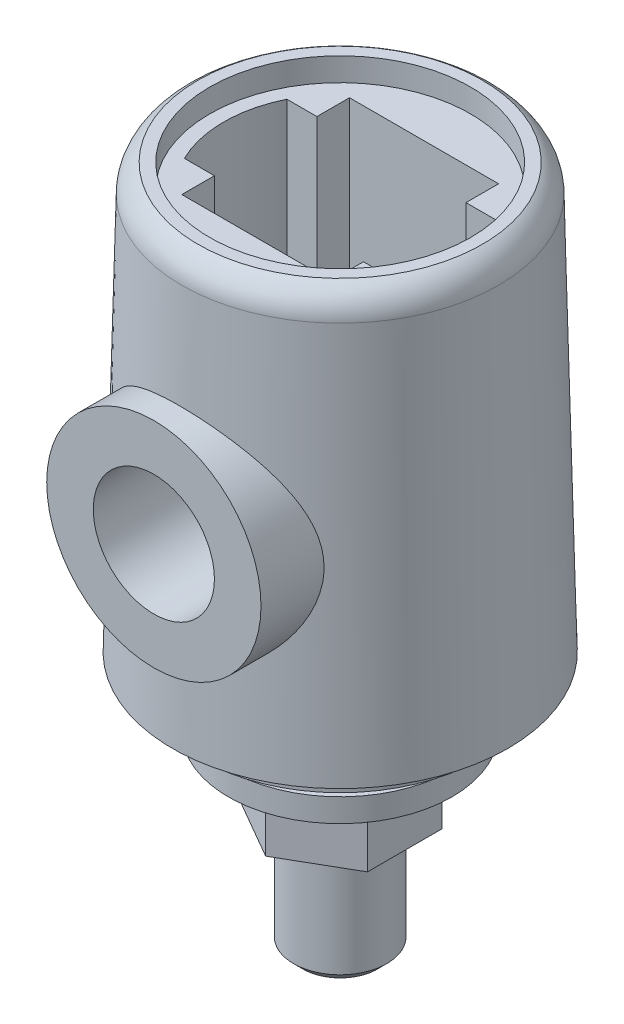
ISO-10303-21;
HEADER;
FILE_DESCRIPTION(('STEP AP214'),'2;1');
FILE_NAME('part.step','',(''),(''),'','','');
FILE_SCHEMA(('AUTOMOTIVE_DESIGN { 1 0 10303 214 1 1 1 1 }'));
ENDSEC;
DATA;
#1=APPLICATION_CONTEXT('core data for automotive mechanical design processes');
#2=APPLICATION_PROTOCOL_DEFINITION('international standard','automotive_design',2000,#1);
#3=PRODUCT_CONTEXT('',#1,'mechanical');
#4=PRODUCT('Part','Part','',(#3));
#5=PRODUCT_RELATED_PRODUCT_CATEGORY('part','',(#4));
#6=PRODUCT_DEFINITION_FORMATION('','',#4);
#7=PRODUCT_DEFINITION_CONTEXT('part definition',#1,'design');
#8=PRODUCT_DEFINITION('design','',#6,#7);
#9=PRODUCT_DEFINITION_SHAPE('','',#8);
#10=(LENGTH_UNIT() NAMED_UNIT(*) SI_UNIT(.MILLI.,.METRE.));
#11=(NAMED_UNIT(*) PLANE_ANGLE_UNIT() SI_UNIT($,.RADIAN.));
#12=(NAMED_UNIT(*) SI_UNIT($,.STERADIAN.) SOLID_ANGLE_UNIT());
#13=UNCERTAINTY_MEASURE_WITH_UNIT(LENGTH_MEASURE(1.E-05),#10,'distance_accuracy_value','');
#14=(GEOMETRIC_REPRESENTATION_CONTEXT(3) GLOBAL_UNCERTAINTY_ASSIGNED_CONTEXT((#13)) GLOBAL_UNIT_ASSIGNED_CONTEXT((#10,
#11,#12)) REPRESENTATION_CONTEXT('',''));
#15=CARTESIAN_POINT('',(0.,0.,0.));
#16=DIRECTION('',(0.,0.,1.));
#17=DIRECTION('',(1.,0.,0.));
#18=AXIS2_PLACEMENT_3D('',#15,#16,#17);
#19=CARTESIAN_POINT('',(0.,47.5,-18.));
#20=DIRECTION('',(0.,0.,1.));
#21=DIRECTION('',(1.,0.,0.));
#22=AXIS2_PLACEMENT_3D('',#19,#20,#21);
#23=CYLINDRICAL_SURFACE('',#22,6.5);
#24=CARTESIAN_POINT('',(0.,47.5,9.));
#25=DIRECTION('',(0.,0.,1.));
#26=DIRECTION('',(1.,0.,0.));
#27=AXIS2_PLACEMENT_3D('',#24,#25,#26);
#28=CIRCLE('',#27,6.5);
#29=CARTESIAN_POINT('',(6.5,47.5,9.));
#30=VERTEX_POINT('',#29);
#31=EDGE_CURVE('E267',#30,#30,#28,.F.);
#32=ORIENTED_EDGE('',*,*,#31,.T.);
#33=EDGE_LOOP('',(#32));
#34=FACE_BOUND('',#33,.T.);
#35=CARTESIAN_POINT('',(0.,47.5,20.));
#36=DIRECTION('',(0.,0.,1.));
#37=DIRECTION('',(1.,0.,0.));
#38=AXIS2_PLACEMENT_3D('',#35,#36,#37);
#39=CIRCLE('',#38,6.5);
#40=CARTESIAN_POINT('',(6.5,47.5,20.));
#41=VERTEX_POINT('',#40);
#42=EDGE_CURVE('E274',#41,#41,#39,.T.);
#43=ORIENTED_EDGE('',*,*,#42,.T.);
#44=EDGE_LOOP('',(#43));
#45=FACE_BOUND('',#44,.T.);
#46=ADVANCED_FACE('F34',(#34,#45),#23,.F.);
#47=CARTESIAN_POINT('',(-7.99999504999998,19.5000000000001,0.));
#48=DIRECTION('',(0.,1.,0.));
#49=DIRECTION('',(-1.,0.,0.));
#50=AXIS2_PLACEMENT_3D('',#47,#48,#49);
#51=PLANE('',#50);
#52=CARTESIAN_POINT('',(0.,19.5000000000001,0.));
#53=DIRECTION('',(0.,1.,0.));
#54=DIRECTION('',(-1.,0.,0.));
#55=AXIS2_PLACEMENT_3D('',#52,#53,#54);
#56=CIRCLE('',#55,4.99999999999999);
#57=CARTESIAN_POINT('',(-4.99999999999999,19.5000000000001,0.));
#58=VERTEX_POINT('',#57);
#59=EDGE_CURVE('E631',#58,#58,#56,.T.);
#60=ORIENTED_EDGE('',*,*,#59,.F.);
#61=EDGE_LOOP('',(#60));
#62=FACE_BOUND('',#61,.T.);
#63=DIRECTION('',(0.866025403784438,0.,0.500000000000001));
#64=VECTOR('',#63,1.);
#65=CARTESIAN_POINT('',(0.,19.5,8.00000050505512));
#66=LINE('',#65,#64);
#67=CARTESIAN_POINT('',(0.,19.5000000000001,7.99999504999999));
#68=VERTEX_POINT('',#67);
#69=CARTESIAN_POINT('',(-6.92819894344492,19.5000000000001,4.00000298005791));
#70=VERTEX_POINT('',#69);
#71=EDGE_CURVE('E463',#68,#70,#66,.F.);
#72=ORIENTED_EDGE('',*,*,#71,.F.);
#73=DIRECTION('',(0.866025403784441,0.,-0.499999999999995));
#74=VECTOR('',#73,1.);
#75=CARTESIAN_POINT('',(6.92820366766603,19.5000000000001,4.00000025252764));
#76=LINE('',#75,#74);
#77=CARTESIAN_POINT('',(6.92820366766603,19.5000000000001,3.99999479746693));
#78=VERTEX_POINT('',#77);
#79=EDGE_CURVE('E60',#78,#68,#76,.F.);
#80=ORIENTED_EDGE('',*,*,#79,.F.);
#81=DIRECTION('',(0.,0.,-1.));
#82=VECTOR('',#81,1.);
#83=CARTESIAN_POINT('',(6.92820366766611,19.5000000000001,-4.0000002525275));
#84=LINE('',#83,#82);
#85=CARTESIAN_POINT('',(6.92819894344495,19.5000000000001,-4.00000298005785));
#86=VERTEX_POINT('',#85);
#87=EDGE_CURVE('E449',#86,#78,#84,.F.);
#88=ORIENTED_EDGE('',*,*,#87,.F.);
#89=DIRECTION('',(-0.866025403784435,0.,-0.500000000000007));
#90=VECTOR('',#89,1.);
#91=CARTESIAN_POINT('',(0.,19.5000000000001,-8.00000050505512));
#92=LINE('',#91,#90);
#93=CARTESIAN_POINT('',(-4.7242211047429E-06,19.5000000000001,-7.99999777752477));
#94=VERTEX_POINT('',#93);
#95=EDGE_CURVE('E473',#94,#86,#92,.F.);
#96=ORIENTED_EDGE('',*,*,#95,.F.);
#97=DIRECTION('',(-0.866025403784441,0.,0.499999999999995));
#98=VECTOR('',#97,1.);
#99=CARTESIAN_POINT('',(-6.92820366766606,19.5000000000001,-4.00000025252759));
#100=LINE('',#99,#98);
#101=CARTESIAN_POINT('',(-6.92820366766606,19.5000000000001,-3.99999479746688));
#102=VERTEX_POINT('',#101);
#103=EDGE_CURVE('E469',#102,#94,#100,.F.);
#104=ORIENTED_EDGE('',*,*,#103,.F.);
#105=DIRECTION('',(0.,0.,1.));
#106=VECTOR('',#105,1.);
#107=CARTESIAN_POINT('',(-6.92820366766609,19.5000000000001,4.00000025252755));
#108=LINE('',#107,#106);
#109=EDGE_CURVE('E465',#70,#102,#108,.F.);
#110=ORIENTED_EDGE('',*,*,#109,.F.);
#111=EDGE_LOOP('',(#72,#80,#88,#96,#104,#110));
#112=FACE_BOUND('',#111,.T.);
#113=ADVANCED_FACE('F487',(#62,#112),#51,.T.);
#114=CARTESIAN_POINT('',(0.,69.975888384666,0.));
#115=DIRECTION('',(0.,1.,0.));
#116=DIRECTION('',(-1.,0.,0.));
#117=AXIS2_PLACEMENT_3D('',#114,#115,#116);
#118=TOROIDAL_SURFACE('',#117,13.5009658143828,3.5);
#119=CARTESIAN_POINT('',(0.,70.0581061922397,0.));
#120=DIRECTION('',(0.,1.,0.));
#121=DIRECTION('',(-1.,0.,0.));
#122=AXIS2_PLACEMENT_3D('',#119,#120,#121);
#123=CIRCLE('',#122,17.);
#124=CARTESIAN_POINT('',(-17.,70.0581061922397,0.));
#125=VERTEX_POINT('',#124);
#126=EDGE_CURVE('E45',#125,#125,#123,.T.);
#127=ORIENTED_EDGE('',*,*,#126,.T.);
#128=EDGE_LOOP('',(#127));
#129=FACE_BOUND('',#128,.T.);
#130=CARTESIAN_POINT('',(0.,73.,0.));
#131=DIRECTION('',(0.,1.,0.));
#132=DIRECTION('',(-1.,0.,0.));
#133=AXIS2_PLACEMENT_3D('',#130,#131,#132);
#134=CIRCLE('',#133,15.262995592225);
#135=CARTESIAN_POINT('',(-15.262995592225,73.,0.));
#136=VERTEX_POINT('',#135);
#137=EDGE_CURVE('E614',#136,#136,#134,.T.);
#138=ORIENTED_EDGE('',*,*,#137,.F.);
#139=EDGE_LOOP('',(#138));
#140=FACE_BOUND('',#139,.T.);
#141=ADVANCED_FACE('F36',(#129,#140),#118,.T.);
#142=CARTESIAN_POINT('',(0.,70.0581061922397,0.));
#143=DIRECTION('',(0.,-1.,0.));
#144=DIRECTION('',(1.,0.,0.));
#145=AXIS2_PLACEMENT_3D('',#142,#143,#144);
#146=CONICAL_SURFACE('',#145,17.,0.0234929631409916);
#147=CARTESIAN_POINT('',(-4.72952026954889,43.0411169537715,-16.9887822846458));
#148=CARTESIAN_POINT('',(-4.85368480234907,43.1728196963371,-16.9510032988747));
#149=CARTESIAN_POINT('',(-4.97237199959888,43.3097369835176,-16.9131348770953));
#150=CARTESIAN_POINT('',(-5.19805079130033,43.5931956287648,-16.8381750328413));
#151=CARTESIAN_POINT('',(-5.30503545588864,43.7397426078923,-16.8010840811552));
#152=CARTESIAN_POINT('',(-5.50680343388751,44.0419376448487,-16.728563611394));
#153=CARTESIAN_POINT('',(-5.60155710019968,44.1976065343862,-16.6931382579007));
#154=CARTESIAN_POINT('',(-5.77787188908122,44.5168071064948,-16.6249945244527));
#155=CARTESIAN_POINT('',(-5.85943348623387,44.6803385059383,-16.5922760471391));
#156=CARTESIAN_POINT('',(-6.00885955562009,45.0146053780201,-16.5303924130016));
#157=CARTESIAN_POINT('',(-6.07669627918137,45.1853546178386,-16.501234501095));
#158=CARTESIAN_POINT('',(-6.19781261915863,45.5325394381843,-16.4474090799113));
#159=CARTESIAN_POINT('',(-6.25109941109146,45.7089721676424,-16.4227393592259));
#160=CARTESIAN_POINT('',(-6.34257086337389,46.0662070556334,-16.3786287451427));
#161=CARTESIAN_POINT('',(-6.38076736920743,46.2470056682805,-16.3591837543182));
#162=CARTESIAN_POINT('',(-6.44167071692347,46.6117139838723,-16.3260862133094));
#163=CARTESIAN_POINT('',(-6.46437854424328,46.7956234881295,-16.3124332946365));
#164=CARTESIAN_POINT('',(-6.49328062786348,47.1559722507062,-16.2918344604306));
#165=CARTESIAN_POINT('',(-6.5002320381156,47.3323341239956,-16.2845917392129));
#166=CARTESIAN_POINT('',(-6.49975616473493,47.6851794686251,-16.2758545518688));
#167=CARTESIAN_POINT('',(-6.4923293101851,47.8616629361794,-16.2743599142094));
#168=CARTESIAN_POINT('',(-6.46314234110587,48.213397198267,-16.2770808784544));
#169=CARTESIAN_POINT('',(-6.4413819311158,48.3886479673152,-16.2812965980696));
#170=CARTESIAN_POINT('',(-6.38372580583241,48.7365841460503,-16.2952089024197));
#171=CARTESIAN_POINT('',(-6.34783020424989,48.9092695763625,-16.3049054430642));
#172=CARTESIAN_POINT('',(-6.26374115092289,49.2448239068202,-16.3289447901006));
#173=CARTESIAN_POINT('',(-6.21602258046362,49.4078247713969,-16.3431129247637));
#174=CARTESIAN_POINT('',(-6.10811923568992,49.7292670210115,-16.3756855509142));
#175=CARTESIAN_POINT('',(-6.04793036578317,49.8877068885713,-16.3940914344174));
#176=CARTESIAN_POINT('',(-5.91558134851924,50.1989803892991,-16.4345375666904));
#177=CARTESIAN_POINT('',(-5.84342358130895,50.3518151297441,-16.456577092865));
#178=CARTESIAN_POINT('',(-5.68762083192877,50.6511020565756,-16.5036338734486));
#179=CARTESIAN_POINT('',(-5.6039714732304,50.7975517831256,-16.5286522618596));
#180=CARTESIAN_POINT('',(-5.42163210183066,51.0898371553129,-16.582155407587));
#181=CARTESIAN_POINT('',(-5.32242530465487,51.2353309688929,-16.6107469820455));
#182=CARTESIAN_POINT('',(-5.11268499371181,51.5176344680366,-16.6695597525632));
#183=CARTESIAN_POINT('',(-5.00214755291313,51.6544411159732,-16.6997815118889));
#184=CARTESIAN_POINT('',(-4.77043493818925,51.9185765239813,-16.7609898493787));
#185=CARTESIAN_POINT('',(-4.64925834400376,52.0459040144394,-16.7919765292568));
#186=CARTESIAN_POINT('',(-4.39698299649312,52.2903434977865,-16.8538572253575));
#187=CARTESIAN_POINT('',(-4.26588406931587,52.4074553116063,-16.8847512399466));
#188=CARTESIAN_POINT('',(-3.98741242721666,52.636606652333,-16.9472028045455));
#189=CARTESIAN_POINT('',(-3.83954746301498,52.7480624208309,-16.9787108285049));
#190=CARTESIAN_POINT('',(-3.5346233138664,52.958085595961,-17.0397588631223));
#191=CARTESIAN_POINT('',(-3.37756731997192,53.0566574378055,-17.0692995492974));
#192=CARTESIAN_POINT('',(-3.05516742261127,53.2402414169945,-17.1255602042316));
#193=CARTESIAN_POINT('',(-2.88982101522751,53.3252494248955,-17.1522793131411));
#194=CARTESIAN_POINT('',(-2.5520664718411,53.4809294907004,-17.2020764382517));
#195=CARTESIAN_POINT('',(-2.37966147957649,53.5516078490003,-17.2251560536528));
#196=CARTESIAN_POINT('',(-2.03202464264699,53.6769258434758,-17.2666205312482));
#197=CARTESIAN_POINT('',(-1.85689539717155,53.7318250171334,-17.2850806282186));
#198=CARTESIAN_POINT('',(-1.5022812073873,53.8266753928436,-17.3172661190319));
#199=CARTESIAN_POINT('',(-1.32279810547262,53.8666328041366,-17.3309934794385));
#200=CARTESIAN_POINT('',(-0.960798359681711,53.9312258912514,-17.3533060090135));
#201=CARTESIAN_POINT('',(-0.778282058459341,53.9558632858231,-17.3618917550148));
#202=CARTESIAN_POINT('',(-0.411646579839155,53.9895633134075,-17.3736588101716));
#203=CARTESIAN_POINT('',(-0.227527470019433,53.9986265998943,-17.3768403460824));
#204=CARTESIAN_POINT('',(0.131350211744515,54.0010210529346,-17.3776799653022));
#205=CARTESIAN_POINT('',(0.306103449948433,53.9951369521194,-17.3756135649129));
#206=CARTESIAN_POINT('',(0.654502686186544,53.9693235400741,-17.3665877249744));
#207=CARTESIAN_POINT('',(0.82814829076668,53.9493894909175,-17.3596266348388));
#208=CARTESIAN_POINT('',(1.17295371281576,53.8956714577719,-17.3410063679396));
#209=CARTESIAN_POINT('',(1.34411448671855,53.861892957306,-17.3293490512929));
#210=CARTESIAN_POINT('',(1.68289586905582,53.7807811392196,-17.3016509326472));
#211=CARTESIAN_POINT('',(1.85051512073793,53.7334427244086,-17.2856084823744));
#212=CARTESIAN_POINT('',(2.18020917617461,53.6258963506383,-17.2496653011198));
#213=CARTESIAN_POINT('',(2.34230740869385,53.5657535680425,-17.2297841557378));
#214=CARTESIAN_POINT('',(2.66087123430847,53.432921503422,-17.1866286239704));
#215=CARTESIAN_POINT('',(2.81733489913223,53.3602279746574,-17.163353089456));
#216=CARTESIAN_POINT('',(3.12364878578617,53.2028474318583,-17.1140158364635));
#217=CARTESIAN_POINT('',(3.27349891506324,53.1181602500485,-17.0879540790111));
#218=CARTESIAN_POINT('',(3.56574540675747,52.9373694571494,-17.0337099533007));
#219=CARTESIAN_POINT('',(3.70814141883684,52.8412653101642,-17.0055274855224));
#220=CARTESIAN_POINT('',(3.99137273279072,52.6333492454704,-16.9463646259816));
#221=CARTESIAN_POINT('',(4.13180189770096,52.5210034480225,-16.9153148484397));
#222=CARTESIAN_POINT('',(4.40274898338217,52.2851905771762,-16.8525503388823));
#223=CARTESIAN_POINT('',(4.53326982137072,52.16172680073,-16.8208358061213));
#224=CARTESIAN_POINT('',(4.78375639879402,51.9043099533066,-16.7576111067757));
#225=CARTESIAN_POINT('',(4.9037153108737,51.7703502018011,-16.7261010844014));
#226=CARTESIAN_POINT('',(5.13219961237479,51.492846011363,-16.6642357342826));
#227=CARTESIAN_POINT('',(5.24072917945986,51.3493051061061,-16.6338799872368));
#228=CARTESIAN_POINT('',(5.44899251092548,51.0486597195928,-16.5742838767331));
#229=CARTESIAN_POINT('',(5.54833059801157,50.8912673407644,-16.5451108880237));
#230=CARTESIAN_POINT('',(5.73331802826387,50.5681756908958,-16.4899591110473));
#231=CARTESIAN_POINT('',(5.81897255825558,50.4024795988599,-16.4639791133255));
#232=CARTESIAN_POINT('',(5.97590483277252,50.0638598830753,-16.4161371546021));
#233=CARTESIAN_POINT('',(6.04718443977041,49.890937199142,-16.3942746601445));
#234=CARTESIAN_POINT('',(6.17471395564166,49.5390966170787,-16.3555065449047));
#235=CARTESIAN_POINT('',(6.23096471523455,49.3601790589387,-16.3386006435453));
#236=CARTESIAN_POINT('',(6.32586891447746,49.0052316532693,-16.3110307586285));
#237=CARTESIAN_POINT('',(6.36515393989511,48.8293884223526,-16.3001375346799));
#238=CARTESIAN_POINT('',(6.42901375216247,48.4747975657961,-16.284014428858));
#239=CARTESIAN_POINT('',(6.45358933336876,48.2960500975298,-16.2787842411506));
#240=CARTESIAN_POINT('',(6.48779086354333,47.937107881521,-16.2742637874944));
#241=CARTESIAN_POINT('',(6.49742117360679,47.7569135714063,-16.2749717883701));
#242=CARTESIAN_POINT('',(6.50167386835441,47.3964751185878,-16.2823933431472));
#243=CARTESIAN_POINT('',(6.49629672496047,47.2162309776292,-16.2891067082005));
#244=CARTESIAN_POINT('',(6.47132608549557,46.8667893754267,-16.3078760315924));
#245=CARTESIAN_POINT('',(6.45251234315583,46.6975189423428,-16.3196253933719));
#246=CARTESIAN_POINT('',(6.40174483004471,46.3613286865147,-16.348090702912));
#247=CARTESIAN_POINT('',(6.36978676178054,46.1944096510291,-16.3648082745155));
#248=CARTESIAN_POINT('',(6.29306196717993,45.8641175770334,-16.4027782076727));
#249=CARTESIAN_POINT('',(6.24829831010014,45.7007436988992,-16.4240294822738));
#250=CARTESIAN_POINT('',(6.14634659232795,45.3784428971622,-16.470537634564));
#251=CARTESIAN_POINT('',(6.08915377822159,45.2195177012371,-16.4957960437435));
#252=CARTESIAN_POINT('',(5.96126875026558,44.9032562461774,-16.5503467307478));
#253=CARTESIAN_POINT('',(5.89028002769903,44.746054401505,-16.579722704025));
#254=CARTESIAN_POINT('',(5.73627395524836,44.4381702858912,-16.6412857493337));
#255=CARTESIAN_POINT('',(5.65325250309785,44.287490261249,-16.6734737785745));
#256=CARTESIAN_POINT('',(5.47575014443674,43.9934845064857,-16.7398759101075));
#257=CARTESIAN_POINT('',(5.38126779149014,43.8501597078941,-16.7740902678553));
#258=CARTESIAN_POINT('',(5.18142693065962,43.5716162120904,-16.8437405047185));
#259=CARTESIAN_POINT('',(5.07606794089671,43.436397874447,-16.8791764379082));
#260=CARTESIAN_POINT('',(4.84748217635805,43.1657874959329,-16.9529073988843));
#261=CARTESIAN_POINT('',(4.72352564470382,43.031019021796,-16.9912318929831));
#262=CARTESIAN_POINT('',(4.46465279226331,42.772385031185,-17.0673634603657));
#263=CARTESIAN_POINT('',(4.32973983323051,42.6485161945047,-17.1051706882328));
#264=CARTESIAN_POINT('',(4.04962819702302,42.4123595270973,-17.1793446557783));
#265=CARTESIAN_POINT('',(3.90442404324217,42.300077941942,-17.2157106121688));
#266=CARTESIAN_POINT('',(3.60470781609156,42.0879976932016,-17.2860415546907));
#267=CARTESIAN_POINT('',(3.45019955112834,41.9881939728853,-17.3200075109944));
#268=CARTESIAN_POINT('',(3.13065346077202,41.800544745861,-17.3851081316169));
#269=CARTESIAN_POINT('',(2.96550317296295,41.7128753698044,-17.4161992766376));
#270=CARTESIAN_POINT('',(2.62771928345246,41.5518844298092,-17.4741790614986));
#271=CARTESIAN_POINT('',(2.45508874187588,41.4785570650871,-17.5010693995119));
#272=CARTESIAN_POINT('',(2.10354030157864,41.3469244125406,-17.5499093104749));
#273=CARTESIAN_POINT('',(1.92462342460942,41.2886166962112,-17.571859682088));
#274=CARTESIAN_POINT('',(1.56185212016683,41.1876263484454,-17.6101936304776));
#275=CARTESIAN_POINT('',(1.37799801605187,41.1449426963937,-17.6265775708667));
#276=CARTESIAN_POINT('',(1.01756744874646,41.0776794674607,-17.6525265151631));
#277=CARTESIAN_POINT('',(0.841183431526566,41.0521971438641,-17.6624305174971));
#278=CARTESIAN_POINT('',(0.486696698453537,41.015798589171,-17.676605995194));
#279=CARTESIAN_POINT('',(0.308594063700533,41.0048816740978,-17.680877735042));
#280=CARTESIAN_POINT('',(-0.0478892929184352,40.9977327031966,-17.6836731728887));
#281=CARTESIAN_POINT('',(-0.226269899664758,41.0014956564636,-17.6821988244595));
#282=CARTESIAN_POINT('',(-0.581977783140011,41.023654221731,-17.6735462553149));
#283=CARTESIAN_POINT('',(-0.759305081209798,41.0420495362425,-17.6663681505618));
#284=CARTESIAN_POINT('',(-1.10395824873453,41.0921699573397,-17.6469298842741));
#285=CARTESIAN_POINT('',(-1.27138611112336,41.1232873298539,-17.6349017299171));
#286=CARTESIAN_POINT('',(-1.60294768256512,41.1984554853,-17.6060872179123));
#287=CARTESIAN_POINT('',(-1.76708035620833,41.2425102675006,-17.5892993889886));
#288=CARTESIAN_POINT('',(-2.09101441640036,41.3431792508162,-17.5513559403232));
#289=CARTESIAN_POINT('',(-2.25081360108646,41.3997997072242,-17.5301981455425));
#290=CARTESIAN_POINT('',(-2.56502895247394,41.5251160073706,-17.4840090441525));
#291=CARTESIAN_POINT('',(-2.71944482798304,41.5938125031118,-17.4589775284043));
#292=CARTESIAN_POINT('',(-3.02650008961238,41.7449636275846,-17.4048126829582));
#293=CARTESIAN_POINT('',(-3.1789504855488,41.8277662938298,-17.3755796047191));
#294=CARTESIAN_POINT('',(-3.47629149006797,42.0049710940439,-17.3142948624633));
#295=CARTESIAN_POINT('',(-3.62118424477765,42.0993699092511,-17.2822440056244));
#296=CARTESIAN_POINT('',(-3.90241860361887,42.2989603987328,-17.2161088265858));
#297=CARTESIAN_POINT('',(-4.03877529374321,42.4041321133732,-17.1820283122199));
#298=CARTESIAN_POINT('',(-4.30247067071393,42.6247287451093,-17.1125560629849));
#299=CARTESIAN_POINT('',(-4.42981408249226,42.7401482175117,-17.07716503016));
#300=CARTESIAN_POINT('',(-4.6125651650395,42.9194571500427,-17.0239860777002));
#301=CARTESIAN_POINT('',(-4.67163788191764,42.9797204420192,-17.0063938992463));
#302=CARTESIAN_POINT('',(-4.72952026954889,43.0411169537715,-16.9887822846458));
#303=B_SPLINE_CURVE_WITH_KNOTS('',3,(#147,#148,#149,#150,#151,#152,#153,#154,#155,#156,#157,
#158,#159,#160,#161,#162,#163,#164,#165,#166,#167,#168,#169,#170,#171,#172,#173,#174,#175,#176,
#177,#178,#179,#180,#181,#182,#183,#184,#185,#186,#187,#188,#189,#190,#191,#192,#193,#194,#195,
#196,#197,#198,#199,#200,#201,#202,#203,#204,#205,#206,#207,#208,#209,#210,#211,#212,#213,#214,
#215,#216,#217,#218,#219,#220,#221,#222,#223,#224,#225,#226,#227,#228,#229,#230,#231,#232,#233,
#234,#235,#236,#237,#238,#239,#240,#241,#242,#243,#244,#245,#246,#247,#248,#249,#250,#251,#252,
#253,#254,#255,#256,#257,#258,#259,#260,#261,#262,#263,#264,#265,#266,#267,#268,#269,#270,#271,
#272,#273,#274,#275,#276,#277,#278,#279,#280,#281,#282,#283,#284,#285,#286,#287,#288,#289,#290,
#291,#292,#293,#294,#295,#296,#297,#298,#299,#300,#301,#302),.UNSPECIFIED.,.T.,.F.,(4,2,2,2,2,2,
2,2,2,2,2,2,2,2,2,2,2,2,2,2,2,2,2,2,2,2,2,2,2,2,2,2,2,2,2,2,2,2,2,2,2,2,2,2,2,2,2,2,2,2,2,2,2,2,
2,2,2,2,2,2,2,2,2,2,2,2,2,2,2,2,2,2,2,2,2,2,2,4),(0.,0.554653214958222,1.10963311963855,
1.6659339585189,2.22221478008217,2.77960928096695,3.33672839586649,3.89340931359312,
4.45005481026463,4.97932684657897,5.50858308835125,6.03785024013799,6.56711313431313,
7.07783451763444,7.58872390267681,8.09951181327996,8.61049479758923,9.14511672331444,
9.67992457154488,10.2148039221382,10.7496926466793,11.3124986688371,11.8751104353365,
12.4378931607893,13.0004279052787,13.5530973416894,14.1055368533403,14.6579143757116,
15.2102687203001,15.734230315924,16.2583686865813,16.7822996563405,17.3064278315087,
17.8279493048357,18.3496475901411,18.8713531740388,19.3930832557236,19.9399638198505,
20.4866827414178,21.0337525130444,21.5806216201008,22.1450973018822,22.7093585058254,
23.2735465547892,23.8377026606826,24.3785258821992,24.919319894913,25.4599560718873,
26.0005752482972,26.5121328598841,27.0238578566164,27.5354603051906,28.0472587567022,
28.5716012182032,29.0961228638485,29.6207107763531,30.1453219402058,30.7058971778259,
31.2663010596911,31.8270054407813,32.3874818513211,32.9553908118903,33.5230695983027,
34.0906565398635,34.6582063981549,35.1929979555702,35.7277643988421,36.2623490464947,
36.7969228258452,37.3084905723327,37.8202166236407,38.3321979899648,38.8442070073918,
39.3714236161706,39.8984896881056,40.4245963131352,40.9504250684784,41.2089904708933),.UNSPECIFIED.);
#304=CARTESIAN_POINT('',(-4.72952026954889,43.0411169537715,-16.9887822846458));
#305=VERTEX_POINT('',#304);
#306=EDGE_CURVE('E279',#305,#305,#303,.T.);
#307=ORIENTED_EDGE('',*,*,#306,.F.);
#308=EDGE_LOOP('',(#307));
#309=FACE_BOUND('',#308,.T.);
#310=CARTESIAN_POINT('',(-7.00133875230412,38.3768834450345,16.3047782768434));
#311=CARTESIAN_POINT('',(-6.77181310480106,38.2007387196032,16.4078449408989));
#312=CARTESIAN_POINT('',(-6.53487769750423,38.0326666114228,16.5080562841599));
#313=CARTESIAN_POINT('',(-6.04682177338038,37.7137405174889,16.700972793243));
#314=CARTESIAN_POINT('',(-5.79570513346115,37.5628818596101,16.7936799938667));
#315=CARTESIAN_POINT('',(-5.27997512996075,37.2795065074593,16.9698690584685));
#316=CARTESIAN_POINT('',(-5.01535294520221,37.1470020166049,17.053344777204));
#317=CARTESIAN_POINT('',(-4.47394217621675,36.901786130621,17.2092702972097));
#318=CARTESIAN_POINT('',(-4.19715398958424,36.7890740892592,17.281720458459));
#319=CARTESIAN_POINT('',(-3.63109534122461,36.5841250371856,17.4144037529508));
#320=CARTESIAN_POINT('',(-3.34175559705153,36.4920254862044,17.4745546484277));
#321=CARTESIAN_POINT('',(-2.75422227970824,36.3305298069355,17.5805755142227));
#322=CARTESIAN_POINT('',(-2.45602859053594,36.2611339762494,17.6264452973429));
#323=CARTESIAN_POINT('',(-1.85335481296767,36.1461854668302,17.7026748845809));
#324=CARTESIAN_POINT('',(-1.54887975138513,36.1006144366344,17.7330466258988));
#325=CARTESIAN_POINT('',(-0.936085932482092,36.0340199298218,17.7774953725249));
#326=CARTESIAN_POINT('',(-0.627767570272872,36.0129939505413,17.7915740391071));
#327=CARTESIAN_POINT('',(-0.0396714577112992,35.9966735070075,17.8024998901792));
#328=CARTESIAN_POINT('',(0.240018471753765,35.999112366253,17.8008650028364));
#329=CARTESIAN_POINT('',(0.798053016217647,36.0243254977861,17.7839924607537));
#330=CARTESIAN_POINT('',(1.07639772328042,36.0470983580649,17.768755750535));
#331=CARTESIAN_POINT('',(1.62966939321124,36.1126476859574,17.7250301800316));
#332=CARTESIAN_POINT('',(1.90459619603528,36.1554250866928,17.6965407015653));
#333=CARTESIAN_POINT('',(2.44908625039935,36.2603890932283,17.626946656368));
#334=CARTESIAN_POINT('',(2.71864941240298,36.3225760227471,17.5858418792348));
#335=CARTESIAN_POINT('',(3.24416978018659,36.4638058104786,17.4930465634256));
#336=CARTESIAN_POINT('',(3.5002985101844,36.5423991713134,17.4416395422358));
#337=CARTESIAN_POINT('',(4.00453076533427,36.7164523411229,17.3286235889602));
#338=CARTESIAN_POINT('',(4.2526314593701,36.8119180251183,17.2670111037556));
#339=CARTESIAN_POINT('',(4.73951961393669,37.0187357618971,17.1347215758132));
#340=CARTESIAN_POINT('',(4.97830952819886,37.1300835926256,17.0640469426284));
#341=CARTESIAN_POINT('',(5.44582103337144,37.3677823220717,16.9147820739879));
#342=CARTESIAN_POINT('',(5.67453895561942,37.4941386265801,16.8361889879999));
#343=CARTESIAN_POINT('',(6.14685863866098,37.776303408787,16.6628937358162));
#344=CARTESIAN_POINT('',(6.38913753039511,37.9338279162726,16.5673789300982));
#345=CARTESIAN_POINT('',(6.85950835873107,38.2652842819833,16.3697847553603));
#346=CARTESIAN_POINT('',(7.08759405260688,38.439223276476,16.2677025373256));
#347=CARTESIAN_POINT('',(7.52910711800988,38.8026223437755,16.0587003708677));
#348=CARTESIAN_POINT('',(7.74251947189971,38.9920978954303,15.9517756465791));
#349=CARTESIAN_POINT('',(8.15387027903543,39.3854837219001,15.7350707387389));
#350=CARTESIAN_POINT('',(8.35181335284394,39.589389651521,15.6252914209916));
#351=CARTESIAN_POINT('',(8.76301622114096,40.045559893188,15.3866651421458));
#352=CARTESIAN_POINT('',(8.97346729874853,40.3002719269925,15.2576426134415));
#353=CARTESIAN_POINT('',(9.37213696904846,40.8274966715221,15.0014491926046));
#354=CARTESIAN_POINT('',(9.56035134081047,41.1000127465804,14.8742786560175));
#355=CARTESIAN_POINT('',(9.91348093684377,41.6619377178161,14.6253416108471));
#356=CARTESIAN_POINT('',(10.0784052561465,41.9513399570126,14.50357300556));
#357=CARTESIAN_POINT('',(10.3837718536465,42.5463123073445,14.2692518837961));
#358=CARTESIAN_POINT('',(10.5242214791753,42.8518775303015,14.1566966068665));
#359=CARTESIAN_POINT('',(10.7503190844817,43.4074275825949,13.9689176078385));
#360=CARTESIAN_POINT('',(10.8411809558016,43.654388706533,13.8910021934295));
#361=CARTESIAN_POINT('',(11.0064458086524,44.1566471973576,13.7453097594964));
#362=CARTESIAN_POINT('',(11.0808528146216,44.4119425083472,13.6775302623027));
#363=CARTESIAN_POINT('',(11.212218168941,44.9295253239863,13.554272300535));
#364=CARTESIAN_POINT('',(11.2692006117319,45.1918026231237,13.4987768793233));
#365=CARTESIAN_POINT('',(11.3649579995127,45.7222624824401,13.4019186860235));
#366=CARTESIAN_POINT('',(11.4037330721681,45.9904450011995,13.3605558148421));
#367=CARTESIAN_POINT('',(11.4625380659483,46.5329346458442,13.2933146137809));
#368=CARTESIAN_POINT('',(11.4824211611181,46.807273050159,13.2675581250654));
#369=CARTESIAN_POINT('',(11.5024175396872,47.3577479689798,13.2330933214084));
#370=CARTESIAN_POINT('',(11.5025311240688,47.6338844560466,13.2243847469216));
#371=CARTESIAN_POINT('',(11.4828703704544,48.1854556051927,13.2243000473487));
#372=CARTESIAN_POINT('',(11.4630953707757,48.4608902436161,13.2329244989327));
#373=CARTESIAN_POINT('',(11.4039489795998,49.0085798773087,13.2669637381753));
#374=CARTESIAN_POINT('',(11.364578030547,49.2808349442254,13.2923781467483));
#375=CARTESIAN_POINT('',(11.2720796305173,49.7913348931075,13.355186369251));
#376=CARTESIAN_POINT('',(11.2208553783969,50.0301229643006,13.3910227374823));
#377=CARTESIAN_POINT('',(11.1038655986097,50.5022213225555,13.4738178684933));
#378=CARTESIAN_POINT('',(11.0380946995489,50.7355295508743,13.5207807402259));
#379=CARTESIAN_POINT('',(10.8926690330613,51.1956754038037,13.6243706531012));
#380=CARTESIAN_POINT('',(10.8130080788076,51.4225100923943,13.6810020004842));
#381=CARTESIAN_POINT('',(10.6404906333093,51.8688946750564,13.8023630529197));
#382=CARTESIAN_POINT('',(10.5476314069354,52.0884430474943,13.8670944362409));
#383=CARTESIAN_POINT('',(10.3091056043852,52.607215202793,14.030702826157));
#384=CARTESIAN_POINT('',(10.1572993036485,52.9026260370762,14.1327781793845));
#385=CARTESIAN_POINT('',(9.83034698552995,53.4769168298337,14.3457641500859));
#386=CARTESIAN_POINT('',(9.65519327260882,53.7557912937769,14.4566776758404));
#387=CARTESIAN_POINT('',(9.28250895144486,54.2965431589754,14.6837277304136));
#388=CARTESIAN_POINT('',(9.08494661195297,54.5583956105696,14.7998715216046));
#389=CARTESIAN_POINT('',(8.66864690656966,55.0638448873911,15.0337850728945));
#390=CARTESIAN_POINT('',(8.44991159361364,55.3074434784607,15.1515546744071));
#391=CARTESIAN_POINT('',(7.9896723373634,55.7779564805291,15.3868030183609));
#392=CARTESIAN_POINT('',(7.74795336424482,56.0046687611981,15.5042657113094));
#393=CARTESIAN_POINT('',(7.24454223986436,56.4373803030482,15.7345903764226));
#394=CARTESIAN_POINT('',(6.98284877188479,56.6433781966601,15.8474520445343));
#395=CARTESIAN_POINT('',(6.44082658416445,57.0329421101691,16.0655073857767));
#396=CARTESIAN_POINT('',(6.1605232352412,57.2165377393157,16.170711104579));
#397=CARTESIAN_POINT('',(5.5822188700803,57.5599131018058,16.3708129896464));
#398=CARTESIAN_POINT('',(5.28422155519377,57.7196977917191,16.465713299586));
#399=CARTESIAN_POINT('',(4.72465654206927,57.9884102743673,16.6273963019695));
#400=CARTESIAN_POINT('',(4.46560135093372,58.1013606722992,16.6962102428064));
#401=CARTESIAN_POINT('',(3.93768200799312,58.308562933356,16.8235360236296));
#402=CARTESIAN_POINT('',(3.66881954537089,58.4028179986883,16.882049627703));
#403=CARTESIAN_POINT('',(3.12285910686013,58.5715557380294,16.9874820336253));
#404=CARTESIAN_POINT('',(2.84576479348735,58.6460470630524,17.0344059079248));
#405=CARTESIAN_POINT('',(2.28499281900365,58.7743750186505,17.1156073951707));
#406=CARTESIAN_POINT('',(2.00131506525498,58.8282113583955,17.1498848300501));
#407=CARTESIAN_POINT('',(1.42832137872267,58.9146467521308,17.2050632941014));
#408=CARTESIAN_POINT('',(1.13898801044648,58.9471636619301,17.2259125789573));
#409=CARTESIAN_POINT('',(0.558011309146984,58.990146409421,17.2534954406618));
#410=CARTESIAN_POINT('',(0.266367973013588,59.0006122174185,17.260228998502));
#411=CARTESIAN_POINT('',(-0.316839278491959,58.9993324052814,17.2594063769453));
#412=CARTESIAN_POINT('',(-0.608403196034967,58.9875874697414,17.2518506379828));
#413=CARTESIAN_POINT('',(-1.18908169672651,58.942066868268,17.2226450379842));
#414=CARTESIAN_POINT('',(-1.47819636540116,58.9082919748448,17.2009956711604));
#415=CARTESIAN_POINT('',(-2.03370493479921,58.8220155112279,17.1459416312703));
#416=CARTESIAN_POINT('',(-2.30038582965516,58.7708225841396,17.1133601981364));
#417=CARTESIAN_POINT('',(-2.82792215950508,58.6501599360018,17.0370077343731));
#418=CARTESIAN_POINT('',(-3.08877788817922,58.5806911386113,16.9932372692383));
#419=CARTESIAN_POINT('',(-3.60316560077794,58.4242604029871,16.8954087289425));
#420=CARTESIAN_POINT('',(-3.85669828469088,58.3373001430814,16.8413516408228));
#421=CARTESIAN_POINT('',(-4.35530182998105,58.1467184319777,16.7239770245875));
#422=CARTESIAN_POINT('',(-4.60036953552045,58.0430908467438,16.6606560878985));
#423=CARTESIAN_POINT('',(-5.09678736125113,57.8127345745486,16.5214776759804));
#424=CARTESIAN_POINT('',(-5.34748430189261,57.6849325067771,16.4450685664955));
#425=CARTESIAN_POINT('',(-5.83707926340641,57.4124687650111,16.2845293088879));
#426=CARTESIAN_POINT('',(-6.07597223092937,57.2677999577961,16.2003958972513));
#427=CARTESIAN_POINT('',(-6.54116083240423,56.9625914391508,16.0259703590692));
#428=CARTESIAN_POINT('',(-6.76745147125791,56.8020455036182,15.9356758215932));
#429=CARTESIAN_POINT('',(-7.20672422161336,56.4660253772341,15.7505794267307));
#430=CARTESIAN_POINT('',(-7.41970496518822,56.2905496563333,15.6557771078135));
#431=CARTESIAN_POINT('',(-7.86338851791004,55.8974936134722,15.4486111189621));
#432=CARTESIAN_POINT('',(-8.09181143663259,55.677580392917,15.335781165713));
#433=CARTESIAN_POINT('',(-8.5295295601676,55.2199358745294,15.1090619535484));
#434=CARTESIAN_POINT('',(-8.73882202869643,54.982202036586,14.9951725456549));
#435=CARTESIAN_POINT('',(-9.13755143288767,54.4896766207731,14.7691978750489));
#436=CARTESIAN_POINT('',(-9.32698211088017,54.234879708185,14.657113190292));
#437=CARTESIAN_POINT('',(-9.684994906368,53.7090273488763,14.4379313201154));
#438=CARTESIAN_POINT('',(-9.85358011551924,53.4379743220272,14.3308333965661));
#439=CARTESIAN_POINT('',(-10.1473438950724,52.9182988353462,14.1390649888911));
#440=CARTESIAN_POINT('',(-10.2753073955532,52.671643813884,14.0533258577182));
#441=CARTESIAN_POINT('',(-10.5140254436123,52.1672402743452,13.8905001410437));
#442=CARTESIAN_POINT('',(-10.6247745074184,51.909488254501,13.8134163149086));
#443=CARTESIAN_POINT('',(-10.8278777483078,51.384106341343,13.6705441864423));
#444=CARTESIAN_POINT('',(-10.9202518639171,51.1164875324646,13.6047436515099));
#445=CARTESIAN_POINT('',(-11.0855992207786,50.5724973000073,13.4869050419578));
#446=CARTESIAN_POINT('',(-11.1585835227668,50.2961309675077,13.4348591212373));
#447=CARTESIAN_POINT('',(-11.2847948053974,49.7332604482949,13.3463534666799));
#448=CARTESIAN_POINT('',(-11.3378031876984,49.4466796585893,13.3100655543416));
#449=CARTESIAN_POINT('',(-11.422007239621,48.8685924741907,13.2558139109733));
#450=CARTESIAN_POINT('',(-11.45320360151,48.5770862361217,13.2378495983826));
#451=CARTESIAN_POINT('',(-11.4931976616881,47.9922031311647,13.2213572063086));
#452=CARTESIAN_POINT('',(-11.5020121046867,47.6988278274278,13.2228145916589));
#453=CARTESIAN_POINT('',(-11.4972183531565,47.1130276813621,13.2452156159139));
#454=CARTESIAN_POINT('',(-11.4836120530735,46.8206027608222,13.2661576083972));
#455=CARTESIAN_POINT('',(-11.438196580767,46.2839683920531,13.3219395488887));
#456=CARTESIAN_POINT('',(-11.4094829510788,46.0392126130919,13.3541701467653));
#457=CARTESIAN_POINT('',(-11.3367884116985,45.5538622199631,13.4308653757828));
#458=CARTESIAN_POINT('',(-11.2928032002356,45.3132687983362,13.4753334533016));
#459=CARTESIAN_POINT('',(-11.1901545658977,44.8373384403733,13.5751902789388));
#460=CARTESIAN_POINT('',(-11.1314782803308,44.6020063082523,13.6305885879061));
#461=CARTESIAN_POINT('',(-11.0001465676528,44.1377076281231,13.750768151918));
#462=CARTESIAN_POINT('',(-10.9274880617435,43.9087424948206,13.8155514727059));
#463=CARTESIAN_POINT('',(-10.7392526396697,43.3737259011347,13.9785780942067));
#464=CARTESIAN_POINT('',(-10.6177777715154,43.0707911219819,14.0802864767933));
#465=CARTESIAN_POINT('',(-10.3513271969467,42.4795191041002,14.2944697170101));
#466=CARTESIAN_POINT('',(-10.206351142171,42.191182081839,14.4069447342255));
#467=CARTESIAN_POINT('',(-9.89409422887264,41.629726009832,14.6390768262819));
#468=CARTESIAN_POINT('',(-9.72680368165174,41.3566136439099,14.7587370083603));
#469=CARTESIAN_POINT('',(-9.37104567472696,40.8265166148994,15.0018338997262));
#470=CARTESIAN_POINT('',(-9.18258369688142,40.5695278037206,15.1252696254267));
#471=CARTESIAN_POINT('',(-8.69519667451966,39.9596129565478,15.4290370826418));
#472=CARTESIAN_POINT('',(-8.38488850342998,39.6159241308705,15.6098284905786));
#473=CARTESIAN_POINT('',(-7.72325956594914,38.9667811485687,15.964485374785));
#474=CARTESIAN_POINT('',(-7.37195900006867,38.6613083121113,16.1383542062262));
#475=CARTESIAN_POINT('',(-7.00133875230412,38.3768834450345,16.3047782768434));
#476=B_SPLINE_CURVE_WITH_KNOTS('',3,(#310,#311,#312,#313,#314,#315,#316,#317,#318,#319,#320,
#321,#322,#323,#324,#325,#326,#327,#328,#329,#330,#331,#332,#333,#334,#335,#336,#337,#338,#339,
#340,#341,#342,#343,#344,#345,#346,#347,#348,#349,#350,#351,#352,#353,#354,#355,#356,#357,#358,
#359,#360,#361,#362,#363,#364,#365,#366,#367,#368,#369,#370,#371,#372,#373,#374,#375,#376,#377,
#378,#379,#380,#381,#382,#383,#384,#385,#386,#387,#388,#389,#390,#391,#392,#393,#394,#395,#396,
#397,#398,#399,#400,#401,#402,#403,#404,#405,#406,#407,#408,#409,#410,#411,#412,#413,#414,#415,
#416,#417,#418,#419,#420,#421,#422,#423,#424,#425,#426,#427,#428,#429,#430,#431,#432,#433,#434,
#435,#436,#437,#438,#439,#440,#441,#442,#443,#444,#445,#446,#447,#448,#449,#450,#451,#452,#453,
#454,#455,#456,#457,#458,#459,#460,#461,#462,#463,#464,#465,#466,#467,#468,#469,#470,#471,#472,
#473,#474,#475),.UNSPECIFIED.,.T.,.F.,(4,2,2,2,2,2,2,2,2,2,2,2,2,2,2,2,2,2,2,2,2,2,2,2,2,2,2,2,
2,2,2,2,2,2,2,2,2,2,2,2,2,2,2,2,2,2,2,2,2,2,2,2,2,2,2,2,2,2,2,2,2,2,2,2,2,2,2,2,2,2,2,2,2,2,2,2,
2,2,2,2,2,2,4),(0.,0.921090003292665,1.84192940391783,2.76337814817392,3.68479680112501,
4.61218829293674,5.53959194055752,6.46628018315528,7.39287393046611,8.23093193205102,
9.06893174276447,9.90697064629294,10.7450235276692,11.5625778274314,12.3804173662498,
13.19803989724,14.0159578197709,14.928146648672,15.8407338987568,16.7542416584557,
17.6674755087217,18.7304204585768,19.7935668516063,20.856296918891,21.9187074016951,
22.7412988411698,23.5636888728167,24.38493651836,25.2061784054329,26.033751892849,
26.8613127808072,27.6889012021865,28.51647093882,29.2562195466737,29.9962417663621,
30.7365944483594,31.4771007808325,32.5180399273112,33.5593230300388,34.6020994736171,
35.6447749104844,36.6984027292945,37.7521000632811,38.8043892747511,39.8564591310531,
40.7281723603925,41.5997361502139,42.4709178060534,43.3421117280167,44.2166429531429,
45.0911753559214,45.9656808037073,46.8401555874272,47.6597360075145,48.4792750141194,
49.2987354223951,50.1184981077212,50.9923746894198,51.8666221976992,52.7412137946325,
53.6158951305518,54.6245077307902,55.6332643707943,56.6423378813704,57.6512615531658,
58.5228811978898,59.3947779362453,60.2657233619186,61.136170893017,62.0158848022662,
62.8955707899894,63.7745984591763,64.6535518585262,65.3983401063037,66.1433383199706,
66.8889911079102,67.6348082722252,68.6589281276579,69.6830631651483,70.7076443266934,
71.7319608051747,73.2199958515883,74.7073006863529),.UNSPECIFIED.);
#477=CARTESIAN_POINT('',(-7.00133875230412,38.3768834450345,16.3047782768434));
#478=VERTEX_POINT('',#477);
#479=EDGE_CURVE('E12',#478,#478,#476,.T.);
#480=ORIENTED_EDGE('',*,*,#479,.F.);
#481=EDGE_LOOP('',(#480));
#482=FACE_BOUND('',#481,.T.);
#483=CARTESIAN_POINT('',(0.,27.5,0.));
#484=DIRECTION('',(0.,1.,0.));
#485=DIRECTION('',(-1.,0.,0.));
#486=AXIS2_PLACEMENT_3D('',#483,#484,#485);
#487=CIRCLE('',#486,18.);
#488=CARTESIAN_POINT('',(-18.,27.5,0.));
#489=VERTEX_POINT('',#488);
#490=EDGE_CURVE('E593',#489,#489,#487,.T.);
#491=ORIENTED_EDGE('',*,*,#490,.T.);
#492=EDGE_LOOP('',(#491));
#493=FACE_BOUND('',#492,.T.);
#494=ORIENTED_EDGE('',*,*,#126,.F.);
#495=EDGE_LOOP('',(#494));
#496=FACE_BOUND('',#495,.T.);
#497=ADVANCED_FACE('F287',(#309,#482,#493,#496),#146,.T.);
#498=CARTESIAN_POINT('',(-18.,27.5,0.));
#499=DIRECTION('',(0.,-1.,0.));
#500=DIRECTION('',(1.,0.,0.));
#501=AXIS2_PLACEMENT_3D('',#498,#499,#500);
#502=PLANE('',#501);
#503=CARTESIAN_POINT('',(0.,27.5,0.));
#504=DIRECTION('',(0.,1.,0.));
#505=DIRECTION('',(-1.,0.,0.));
#506=AXIS2_PLACEMENT_3D('',#503,#504,#505);
#507=CIRCLE('',#506,14.9999999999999);
#508=CARTESIAN_POINT('',(-14.9999999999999,27.5,0.));
#509=VERTEX_POINT('',#508);
#510=EDGE_CURVE('E598',#509,#509,#507,.T.);
#511=ORIENTED_EDGE('',*,*,#510,.T.);
#512=EDGE_LOOP('',(#511));
#513=FACE_BOUND('',#512,.T.);
#514=ORIENTED_EDGE('',*,*,#490,.F.);
#515=EDGE_LOOP('',(#514));
#516=FACE_BOUND('',#515,.T.);
#517=ADVANCED_FACE('F587',(#513,#516),#502,.T.);
#518=CARTESIAN_POINT('',(0.,106.340280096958,0.));
#519=DIRECTION('',(0.,1.,0.));
#520=DIRECTION('',(-1.,0.,0.));
#521=AXIS2_PLACEMENT_3D('',#518,#519,#520);
#522=CYLINDRICAL_SURFACE('',#521,14.9999999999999);
#523=CARTESIAN_POINT('',(0.,25.,0.));
#524=DIRECTION('',(0.,1.,0.));
#525=DIRECTION('',(-1.,0.,0.));
#526=AXIS2_PLACEMENT_3D('',#523,#524,#525);
#527=CIRCLE('',#526,14.9999999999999);
#528=CARTESIAN_POINT('',(-14.9999999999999,25.,0.));
#529=VERTEX_POINT('',#528);
#530=EDGE_CURVE('E649',#529,#529,#527,.T.);
#531=ORIENTED_EDGE('',*,*,#530,.T.);
#532=EDGE_LOOP('',(#531));
#533=FACE_BOUND('',#532,.T.);
#534=ORIENTED_EDGE('',*,*,#510,.F.);
#535=EDGE_LOOP('',(#534));
#536=FACE_BOUND('',#535,.T.);
#537=ADVANCED_FACE('F656',(#533,#536),#522,.T.);
#538=CARTESIAN_POINT('',(-14.9999999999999,25.,0.));
#539=DIRECTION('',(0.,-1.,0.));
#540=DIRECTION('',(1.,0.,0.));
#541=AXIS2_PLACEMENT_3D('',#538,#539,#540);
#542=PLANE('',#541);
#543=CARTESIAN_POINT('',(0.,25.,0.));
#544=DIRECTION('',(0.,1.,0.));
#545=DIRECTION('',(-1.,0.,0.));
#546=AXIS2_PLACEMENT_3D('',#543,#544,#545);
#547=CIRCLE('',#546,4.99999999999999);
#548=CARTESIAN_POINT('',(-4.99999999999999,25.,0.));
#549=VERTEX_POINT('',#548);
#550=EDGE_CURVE('E646',#549,#549,#547,.T.);
#551=ORIENTED_EDGE('',*,*,#550,.T.);
#552=EDGE_LOOP('',(#551));
#553=FACE_BOUND('',#552,.T.);
#554=ORIENTED_EDGE('',*,*,#530,.F.);
#555=EDGE_LOOP('',(#554));
#556=FACE_BOUND('',#555,.T.);
#557=ADVANCED_FACE('F658',(#553,#556),#542,.T.);
#558=CARTESIAN_POINT('',(0.,106.340280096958,0.));
#559=DIRECTION('',(0.,1.,0.));
#560=DIRECTION('',(-1.,0.,0.));
#561=AXIS2_PLACEMENT_3D('',#558,#559,#560);
#562=CYLINDRICAL_SURFACE('',#561,4.99999999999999);
#563=CARTESIAN_POINT('',(0.,22.5,0.));
#564=DIRECTION('',(0.,1.,0.));
#565=DIRECTION('',(-1.,0.,0.));
#566=AXIS2_PLACEMENT_3D('',#563,#564,#565);
#567=CIRCLE('',#566,4.99999999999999);
#568=CARTESIAN_POINT('',(-4.99999999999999,22.5,0.));
#569=VERTEX_POINT('',#568);
#570=EDGE_CURVE('E643',#569,#569,#567,.T.);
#571=ORIENTED_EDGE('',*,*,#570,.T.);
#572=EDGE_LOOP('',(#571));
#573=FACE_BOUND('',#572,.T.);
#574=ORIENTED_EDGE('',*,*,#550,.F.);
#575=EDGE_LOOP('',(#574));
#576=FACE_BOUND('',#575,.T.);
#577=ADVANCED_FACE('F665',(#573,#576),#562,.T.);
#578=CARTESIAN_POINT('',(-12.,22.5,0.));
#579=DIRECTION('',(0.,1.,0.));
#580=DIRECTION('',(-1.,0.,0.));
#581=AXIS2_PLACEMENT_3D('',#578,#579,#580);
#582=PLANE('',#581);
#583=CARTESIAN_POINT('',(0.,22.5,0.));
#584=DIRECTION('',(0.,1.,0.));
#585=DIRECTION('',(-1.,0.,0.));
#586=AXIS2_PLACEMENT_3D('',#583,#584,#585);
#587=CIRCLE('',#586,12.);
#588=CARTESIAN_POINT('',(-12.,22.5,0.));
#589=VERTEX_POINT('',#588);
#590=EDGE_CURVE('E640',#589,#589,#587,.T.);
#591=ORIENTED_EDGE('',*,*,#590,.T.);
#592=EDGE_LOOP('',(#591));
#593=FACE_BOUND('',#592,.T.);
#594=ORIENTED_EDGE('',*,*,#570,.F.);
#595=EDGE_LOOP('',(#594));
#596=FACE_BOUND('',#595,.T.);
#597=ADVANCED_FACE('F671',(#593,#596),#582,.T.);
#598=CARTESIAN_POINT('',(0.,106.340280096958,0.));
#599=DIRECTION('',(0.,1.,0.));
#600=DIRECTION('',(-1.,0.,0.));
#601=AXIS2_PLACEMENT_3D('',#598,#599,#600);
#602=CYLINDRICAL_SURFACE('',#601,12.);
#603=CARTESIAN_POINT('',(0.,20.,0.));
#604=DIRECTION('',(0.,1.,0.));
#605=DIRECTION('',(-1.,0.,0.));
#606=AXIS2_PLACEMENT_3D('',#603,#604,#605);
#607=CIRCLE('',#606,12.);
#608=CARTESIAN_POINT('',(-12.,20.,0.));
#609=VERTEX_POINT('',#608);
#610=EDGE_CURVE('E637',#609,#609,#607,.T.);
#611=ORIENTED_EDGE('',*,*,#610,.T.);
#612=EDGE_LOOP('',(#611));
#613=FACE_BOUND('',#612,.T.);
#614=ORIENTED_EDGE('',*,*,#590,.F.);
#615=EDGE_LOOP('',(#614));
#616=FACE_BOUND('',#615,.T.);
#617=ADVANCED_FACE('F675',(#613,#616),#602,.T.);
#618=CARTESIAN_POINT('',(-12.,20.,0.));
#619=DIRECTION('',(0.,-1.,0.));
#620=DIRECTION('',(1.,0.,0.));
#621=AXIS2_PLACEMENT_3D('',#618,#619,#620);
#622=PLANE('',#621);
#623=CARTESIAN_POINT('',(0.,20.,0.));
#624=DIRECTION('',(0.,1.,0.));
#625=DIRECTION('',(-1.,0.,0.));
#626=AXIS2_PLACEMENT_3D('',#623,#624,#625);
#627=CIRCLE('',#626,4.99999999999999);
#628=CARTESIAN_POINT('',(-4.99999999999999,20.,0.));
#629=VERTEX_POINT('',#628);
#630=EDGE_CURVE('E634',#629,#629,#627,.T.);
#631=ORIENTED_EDGE('',*,*,#630,.T.);
#632=EDGE_LOOP('',(#631));
#633=FACE_BOUND('',#632,.T.);
#634=ORIENTED_EDGE('',*,*,#610,.F.);
#635=EDGE_LOOP('',(#634));
#636=FACE_BOUND('',#635,.T.);
#637=ADVANCED_FACE('F679',(#633,#636),#622,.T.);
#638=CARTESIAN_POINT('',(0.,106.340280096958,0.));
#639=DIRECTION('',(0.,1.,0.));
#640=DIRECTION('',(-1.,0.,0.));
#641=AXIS2_PLACEMENT_3D('',#638,#639,#640);
#642=CYLINDRICAL_SURFACE('',#641,4.99999999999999);
#643=ORIENTED_EDGE('',*,*,#59,.T.);
#644=EDGE_LOOP('',(#643));
#645=FACE_BOUND('',#644,.T.);
#646=ORIENTED_EDGE('',*,*,#630,.F.);
#647=EDGE_LOOP('',(#646));
#648=FACE_BOUND('',#647,.T.);
#649=ADVANCED_FACE('F683',(#645,#648),#642,.T.);
#650=CARTESIAN_POINT('',(-15.262995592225,73.,0.));
#651=DIRECTION('',(0.,1.,0.));
#652=DIRECTION('',(-1.,0.,0.));
#653=AXIS2_PLACEMENT_3D('',#650,#651,#652);
#654=PLANE('',#653);
#655=CARTESIAN_POINT('',(0.,73.,0.));
#656=DIRECTION('',(0.,1.,0.));
#657=DIRECTION('',(-1.,0.,0.));
#658=AXIS2_PLACEMENT_3D('',#655,#656,#657);
#659=CIRCLE('',#658,14.);
#660=CARTESIAN_POINT('',(-14.,73.,0.));
#661=VERTEX_POINT('',#660);
#662=EDGE_CURVE('E270',#661,#661,#659,.T.);
#663=ORIENTED_EDGE('',*,*,#662,.F.);
#664=EDGE_LOOP('',(#663));
#665=FACE_BOUND('',#664,.T.);
#666=ORIENTED_EDGE('',*,*,#137,.T.);
#667=EDGE_LOOP('',(#666));
#668=FACE_BOUND('',#667,.T.);
#669=ADVANCED_FACE('F686',(#665,#668),#654,.T.);
#670=CARTESIAN_POINT('',(6.92820366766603,70.9208051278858,4.00000025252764));
#671=DIRECTION('',(0.499999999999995,0.,0.866025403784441));
#672=DIRECTION('',(0.866025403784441,0.,-0.499999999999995));
#673=AXIS2_PLACEMENT_3D('',#670,#671,#672);
#674=PLANE('',#673);
#675=ORIENTED_EDGE('',*,*,#79,.T.);
#676=CARTESIAN_POINT('',(-9.44844231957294E-06,12.5,7.99999504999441));
#677=DIRECTION('',(0.,1.,0.));
#678=VECTOR('',#677,1.);
#679=LINE('',#676,#678);
#680=CARTESIAN_POINT('',(-3.16271061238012E-07,12.5000000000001,7.99999692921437));
#681=VERTEX_POINT('',#680);
#682=EDGE_CURVE('E432',#681,#68,#679,.T.);
#683=ORIENTED_EDGE('',*,*,#682,.F.);
#684=DIRECTION('',(-0.866025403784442,0.,0.499999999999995));
#685=VECTOR('',#684,1.);
#686=CARTESIAN_POINT('',(6.92820366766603,12.5000000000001,4.00000025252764));
#687=LINE('',#686,#685);
#688=CARTESIAN_POINT('',(6.92820072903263,12.5000000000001,3.99999819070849));
#689=VERTEX_POINT('',#688);
#690=EDGE_CURVE('E442',#689,#681,#687,.T.);
#691=ORIENTED_EDGE('',*,*,#690,.F.);
#692=CARTESIAN_POINT('',(6.92820366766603,19.5000000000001,3.99998934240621));
#693=DIRECTION('',(0.,-1.,0.));
#694=VECTOR('',#693,1.);
#695=LINE('',#692,#694);
#696=EDGE_CURVE('E484',#78,#689,#695,.T.);
#697=ORIENTED_EDGE('',*,*,#696,.F.);
#698=EDGE_LOOP('',(#675,#683,#691,#697));
#699=FACE_BOUND('',#698,.T.);
#700=ADVANCED_FACE('F405',(#699),#674,.T.);
#701=CARTESIAN_POINT('',(6.92820366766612,70.9208051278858,-4.0000002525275));
#702=DIRECTION('',(1.,0.,0.));
#703=DIRECTION('',(0.,0.,-1.));
#704=AXIS2_PLACEMENT_3D('',#701,#702,#703);
#705=PLANE('',#704);
#706=ORIENTED_EDGE('',*,*,#87,.T.);
#707=ORIENTED_EDGE('',*,*,#696,.T.);
#708=DIRECTION('',(0.,0.,1.));
#709=VECTOR('',#708,1.);
#710=CARTESIAN_POINT('',(6.92820366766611,12.5000000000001,0.));
#711=LINE('',#710,#709);
#712=CARTESIAN_POINT('',(6.92820041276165,12.5000000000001,-3.9999987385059));
#713=VERTEX_POINT('',#712);
#714=EDGE_CURVE('E453',#713,#689,#711,.T.);
#715=ORIENTED_EDGE('',*,*,#714,.F.);
#716=CARTESIAN_POINT('',(6.9281942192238,19.5000000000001,-4.00000570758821));
#717=DIRECTION('',(0.,-1.,0.));
#718=VECTOR('',#717,1.);
#719=LINE('',#716,#718);
#720=EDGE_CURVE('E391',#86,#713,#719,.T.);
#721=ORIENTED_EDGE('',*,*,#720,.F.);
#722=EDGE_LOOP('',(#706,#707,#715,#721));
#723=FACE_BOUND('',#722,.T.);
#724=ADVANCED_FACE('F396',(#723),#705,.T.);
#725=CARTESIAN_POINT('',(0.,70.9208051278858,-8.00000050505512));
#726=DIRECTION('',(0.500000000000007,0.,-0.866025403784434));
#727=DIRECTION('',(-0.866025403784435,0.,-0.500000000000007));
#728=AXIS2_PLACEMENT_3D('',#725,#726,#727);
#729=PLANE('',#728);
#730=ORIENTED_EDGE('',*,*,#95,.T.);
#731=ORIENTED_EDGE('',*,*,#720,.T.);
#732=DIRECTION('',(0.866025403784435,0.,0.500000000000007));
#733=VECTOR('',#732,1.);
#734=CARTESIAN_POINT('',(0.,12.5000000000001,-8.00000050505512));
#735=LINE('',#734,#733);
#736=CARTESIAN_POINT('',(-3.16271005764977E-07,12.5000000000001,-7.99999692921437));
#737=VERTEX_POINT('',#736);
#738=EDGE_CURVE('E455',#737,#713,#735,.T.);
#739=ORIENTED_EDGE('',*,*,#738,.F.);
#740=CARTESIAN_POINT('',(-9.44844226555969E-06,19.5000000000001,-7.99999504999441));
#741=DIRECTION('',(0.,-1.,0.));
#742=VECTOR('',#741,1.);
#743=LINE('',#740,#742);
#744=EDGE_CURVE('E346',#94,#737,#743,.T.);
#745=ORIENTED_EDGE('',*,*,#744,.F.);
#746=EDGE_LOOP('',(#730,#731,#739,#745));
#747=FACE_BOUND('',#746,.T.);
#748=ADVANCED_FACE('F361',(#747),#729,.T.);
#749=CARTESIAN_POINT('',(-6.92820366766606,70.9208051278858,-4.00000025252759));
#750=DIRECTION('',(-0.499999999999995,0.,-0.866025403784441));
#751=DIRECTION('',(-0.866025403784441,0.,0.499999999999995));
#752=AXIS2_PLACEMENT_3D('',#749,#750,#751);
#753=PLANE('',#752);
#754=ORIENTED_EDGE('',*,*,#103,.T.);
#755=ORIENTED_EDGE('',*,*,#744,.T.);
#756=DIRECTION('',(0.866025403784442,0.,-0.499999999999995));
#757=VECTOR('',#756,1.);
#758=CARTESIAN_POINT('',(-6.92820366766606,12.5000000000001,-4.00000025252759));
#759=LINE('',#758,#757);
#760=CARTESIAN_POINT('',(-6.92820072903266,12.5000000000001,-3.99999819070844));
#761=VERTEX_POINT('',#760);
#762=EDGE_CURVE('E605',#761,#737,#759,.T.);
#763=ORIENTED_EDGE('',*,*,#762,.F.);
#764=CARTESIAN_POINT('',(-6.92820366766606,19.5000000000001,-3.99998934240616));
#765=DIRECTION('',(0.,-1.,0.));
#766=VECTOR('',#765,1.);
#767=LINE('',#764,#766);
#768=EDGE_CURVE('E333',#102,#761,#767,.T.);
#769=ORIENTED_EDGE('',*,*,#768,.F.);
#770=EDGE_LOOP('',(#754,#755,#763,#769));
#771=FACE_BOUND('',#770,.T.);
#772=ADVANCED_FACE('F352',(#771),#753,.T.);
#773=CARTESIAN_POINT('',(-6.92820366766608,70.9208051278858,4.00000025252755));
#774=DIRECTION('',(-1.,0.,0.));
#775=DIRECTION('',(0.,0.,1.));
#776=AXIS2_PLACEMENT_3D('',#773,#774,#775);
#777=PLANE('',#776);
#778=ORIENTED_EDGE('',*,*,#109,.T.);
#779=ORIENTED_EDGE('',*,*,#768,.T.);
#780=DIRECTION('',(0.,0.,1.));
#781=VECTOR('',#780,1.);
#782=CARTESIAN_POINT('',(-6.92820366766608,12.5000000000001,0.));
#783=LINE('',#782,#781);
#784=CARTESIAN_POINT('',(-6.92819894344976,12.5000000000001,3.99999752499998));
#785=VERTEX_POINT('',#784);
#786=EDGE_CURVE('E450',#785,#761,#783,.F.);
#787=ORIENTED_EDGE('',*,*,#786,.F.);
#788=CARTESIAN_POINT('',(-6.92819421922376,19.5,4.00000570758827));
#789=DIRECTION('',(0.,-1.,0.));
#790=VECTOR('',#789,1.);
#791=LINE('',#788,#790);
#792=EDGE_CURVE('E421',#70,#785,#791,.T.);
#793=ORIENTED_EDGE('',*,*,#792,.F.);
#794=EDGE_LOOP('',(#778,#779,#787,#793));
#795=FACE_BOUND('',#794,.T.);
#796=ADVANCED_FACE('F312',(#795),#777,.T.);
#797=CARTESIAN_POINT('',(0.,70.9208051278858,8.00000050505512));
#798=DIRECTION('',(-0.500000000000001,0.,0.866025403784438));
#799=DIRECTION('',(0.866025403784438,0.,0.500000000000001));
#800=AXIS2_PLACEMENT_3D('',#797,#798,#799);
#801=PLANE('',#800);
#802=ORIENTED_EDGE('',*,*,#71,.T.);
#803=ORIENTED_EDGE('',*,*,#792,.T.);
#804=DIRECTION('',(-0.866025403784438,0.,-0.500000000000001));
#805=VECTOR('',#804,1.);
#806=CARTESIAN_POINT('',(0.,12.5000000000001,8.00000050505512));
#807=LINE('',#806,#805);
#808=EDGE_CURVE('E446',#681,#785,#807,.T.);
#809=ORIENTED_EDGE('',*,*,#808,.F.);
#810=ORIENTED_EDGE('',*,*,#682,.T.);
#811=EDGE_LOOP('',(#802,#803,#809,#810));
#812=FACE_BOUND('',#811,.T.);
#813=ADVANCED_FACE('F307',(#812),#801,.T.);
#814=CARTESIAN_POINT('',(-3.99999999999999,0.,0.));
#815=DIRECTION('',(0.,-1.,0.));
#816=DIRECTION('',(1.,0.,0.));
#817=AXIS2_PLACEMENT_3D('',#814,#815,#816);
#818=PLANE('',#817);
#819=CARTESIAN_POINT('',(0.,0.,0.));
#820=DIRECTION('',(0.,1.,0.));
#821=DIRECTION('',(-1.,0.,0.));
#822=AXIS2_PLACEMENT_3D('',#819,#820,#821);
#823=CIRCLE('',#822,3.99999999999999);
#824=CARTESIAN_POINT('',(-3.99999999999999,0.,0.));
#825=VERTEX_POINT('',#824);
#826=EDGE_CURVE('E616',#825,#825,#823,.T.);
#827=ORIENTED_EDGE('',*,*,#826,.F.);
#828=EDGE_LOOP('',(#827));
#829=FACE_BOUND('',#828,.T.);
#830=ADVANCED_FACE('F311',(#829),#818,.T.);
#831=CARTESIAN_POINT('',(0.,1.,0.));
#832=DIRECTION('',(0.,1.,0.));
#833=DIRECTION('',(-1.,0.,0.));
#834=AXIS2_PLACEMENT_3D('',#831,#832,#833);
#835=CONICAL_SURFACE('',#834,4.99999999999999,0.785398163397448);
#836=ORIENTED_EDGE('',*,*,#826,.T.);
#837=EDGE_LOOP('',(#836));
#838=FACE_BOUND('',#837,.T.);
#839=CARTESIAN_POINT('',(0.,1.,0.));
#840=DIRECTION('',(0.,1.,0.));
#841=DIRECTION('',(-1.,0.,0.));
#842=AXIS2_PLACEMENT_3D('',#839,#840,#841);
#843=CIRCLE('',#842,4.99999999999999);
#844=CARTESIAN_POINT('',(-4.99999999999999,1.,0.));
#845=VERTEX_POINT('',#844);
#846=EDGE_CURVE('E621',#845,#845,#843,.T.);
#847=ORIENTED_EDGE('',*,*,#846,.F.);
#848=EDGE_LOOP('',(#847));
#849=FACE_BOUND('',#848,.T.);
#850=ADVANCED_FACE('F695',(#838,#849),#835,.T.);
#851=CARTESIAN_POINT('',(0.,106.340280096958,0.));
#852=DIRECTION('',(0.,1.,0.));
#853=DIRECTION('',(-1.,0.,0.));
#854=AXIS2_PLACEMENT_3D('',#851,#852,#853);
#855=CYLINDRICAL_SURFACE('',#854,4.99999999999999);
#856=ORIENTED_EDGE('',*,*,#846,.T.);
#857=EDGE_LOOP('',(#856));
#858=FACE_BOUND('',#857,.T.);
#859=CARTESIAN_POINT('',(0.,12.5000000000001,0.));
#860=DIRECTION('',(0.,1.,0.));
#861=DIRECTION('',(-1.,0.,0.));
#862=AXIS2_PLACEMENT_3D('',#859,#860,#861);
#863=CIRCLE('',#862,4.99999999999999);
#864=CARTESIAN_POINT('',(-4.99999999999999,12.5000000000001,0.));
#865=VERTEX_POINT('',#864);
#866=EDGE_CURVE('E628',#865,#865,#863,.T.);
#867=ORIENTED_EDGE('',*,*,#866,.F.);
#868=EDGE_LOOP('',(#867));
#869=FACE_BOUND('',#868,.T.);
#870=ADVANCED_FACE('F691',(#858,#869),#855,.T.);
#871=CARTESIAN_POINT('',(-7.99999504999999,12.5000000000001,0.));
#872=DIRECTION('',(0.,-1.,0.));
#873=DIRECTION('',(1.,0.,0.));
#874=AXIS2_PLACEMENT_3D('',#871,#872,#873);
#875=PLANE('',#874);
#876=ORIENTED_EDGE('',*,*,#866,.T.);
#877=EDGE_LOOP('',(#876));
#878=FACE_BOUND('',#877,.T.);
#879=ORIENTED_EDGE('',*,*,#714,.T.);
#880=ORIENTED_EDGE('',*,*,#690,.T.);
#881=ORIENTED_EDGE('',*,*,#808,.T.);
#882=ORIENTED_EDGE('',*,*,#786,.T.);
#883=ORIENTED_EDGE('',*,*,#762,.T.);
#884=ORIENTED_EDGE('',*,*,#738,.T.);
#885=EDGE_LOOP('',(#879,#880,#881,#882,#883,#884));
#886=FACE_BOUND('',#885,.T.);
#887=ADVANCED_FACE('F305',(#878,#886),#875,.T.);
#888=CARTESIAN_POINT('',(0.,47.5,-13.));
#889=DIRECTION('',(0.,0.,1.));
#890=DIRECTION('',(1.,0.,0.));
#891=AXIS2_PLACEMENT_3D('',#888,#889,#890);
#892=CYLINDRICAL_SURFACE('',#891,11.5);
#893=ORIENTED_EDGE('',*,*,#479,.T.);
#894=EDGE_LOOP('',(#893));
#895=FACE_BOUND('',#894,.T.);
#896=CARTESIAN_POINT('',(0.,47.5,20.));
#897=DIRECTION('',(0.,0.,1.));
#898=DIRECTION('',(1.,0.,0.));
#899=AXIS2_PLACEMENT_3D('',#896,#897,#898);
#900=CIRCLE('',#899,11.5);
#901=CARTESIAN_POINT('',(11.5,47.5,20.));
#902=VERTEX_POINT('',#901);
#903=EDGE_CURVE('E285',#902,#902,#900,.T.);
#904=ORIENTED_EDGE('',*,*,#903,.F.);
#905=EDGE_LOOP('',(#904));
#906=FACE_BOUND('',#905,.T.);
#907=ADVANCED_FACE('F300',(#895,#906),#892,.T.);
#908=CARTESIAN_POINT('',(0.,47.5,20.));
#909=DIRECTION('',(0.,0.,1.));
#910=DIRECTION('',(1.,0.,0.));
#911=AXIS2_PLACEMENT_3D('',#908,#909,#910);
#912=PLANE('',#911);
#913=ORIENTED_EDGE('',*,*,#42,.F.);
#914=EDGE_LOOP('',(#913));
#915=FACE_BOUND('',#914,.T.);
#916=ORIENTED_EDGE('',*,*,#903,.T.);
#917=EDGE_LOOP('',(#916));
#918=FACE_BOUND('',#917,.T.);
#919=ADVANCED_FACE('F296',(#915,#918),#912,.T.);
#920=CARTESIAN_POINT('',(0.,47.5,-9.));
#921=DIRECTION('',(0.,0.,-1.));
#922=DIRECTION('',(-1.,0.,0.));
#923=AXIS2_PLACEMENT_3D('',#920,#921,#922);
#924=CIRCLE('',#923,6.5);
#925=CARTESIAN_POINT('',(-6.5,47.5,-9.));
#926=VERTEX_POINT('',#925);
#927=EDGE_CURVE('E245',#926,#926,#924,.F.);
#928=ORIENTED_EDGE('',*,*,#927,.T.);
#929=EDGE_LOOP('',(#928));
#930=FACE_BOUND('',#929,.T.);
#931=ORIENTED_EDGE('',*,*,#306,.T.);
#932=EDGE_LOOP('',(#931));
#933=FACE_BOUND('',#932,.T.);
#934=ADVANCED_FACE('F290',(#930,#933),#23,.F.);
#935=CARTESIAN_POINT('',(0.,70.5,0.));
#936=DIRECTION('',(0.,1.,0.));
#937=DIRECTION('',(-1.,0.,0.));
#938=AXIS2_PLACEMENT_3D('',#935,#936,#937);
#939=CYLINDRICAL_SURFACE('',#938,14.);
#940=CARTESIAN_POINT('',(0.,70.5,0.));
#941=DIRECTION('',(0.,1.,0.));
#942=DIRECTION('',(-1.,0.,0.));
#943=AXIS2_PLACEMENT_3D('',#940,#941,#942);
#944=CIRCLE('',#943,14.);
#945=CARTESIAN_POINT('',(-14.,70.5,0.));
#946=VERTEX_POINT('',#945);
#947=EDGE_CURVE('E271',#946,#946,#944,.T.);
#948=ORIENTED_EDGE('',*,*,#947,.F.);
#949=EDGE_LOOP('',(#948));
#950=FACE_BOUND('',#949,.T.);
#951=ORIENTED_EDGE('',*,*,#662,.T.);
#952=EDGE_LOOP('',(#951));
#953=FACE_BOUND('',#952,.T.);
#954=ADVANCED_FACE('F295',(#950,#953),#939,.F.);
#955=CARTESIAN_POINT('',(0.,70.5,0.));
#956=DIRECTION('',(0.,1.,0.));
#957=DIRECTION('',(-1.,0.,0.));
#958=AXIS2_PLACEMENT_3D('',#955,#956,#957);
#959=PLANE('',#958);
#960=DIRECTION('',(1.,0.,0.));
#961=VECTOR('',#960,1.);
#962=CARTESIAN_POINT('',(11.2249721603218,70.5,5.5));
#963=LINE('',#962,#961);
#964=CARTESIAN_POINT('',(8.,70.5,5.5));
#965=VERTEX_POINT('',#964);
#966=CARTESIAN_POINT('',(11.2249721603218,70.5,5.5));
#967=VERTEX_POINT('',#966);
#968=EDGE_CURVE('E52',#965,#967,#963,.T.);
#969=ORIENTED_EDGE('',*,*,#968,.F.);
#970=DIRECTION('',(0.,0.,-1.));
#971=VECTOR('',#970,1.);
#972=CARTESIAN_POINT('',(8.,70.5,9.));
#973=LINE('',#972,#971);
#974=CARTESIAN_POINT('',(8.,70.5,9.));
#975=VERTEX_POINT('',#974);
#976=EDGE_CURVE('E183',#975,#965,#973,.T.);
#977=ORIENTED_EDGE('',*,*,#976,.F.);
#978=DIRECTION('',(1.,0.,0.));
#979=VECTOR('',#978,1.);
#980=CARTESIAN_POINT('',(8.,70.5,9.));
#981=LINE('',#980,#979);
#982=CARTESIAN_POINT('',(-8.,70.5,9.));
#983=VERTEX_POINT('',#982);
#984=EDGE_CURVE('E186',#983,#975,#981,.T.);
#985=ORIENTED_EDGE('',*,*,#984,.F.);
#986=DIRECTION('',(0.,0.,1.));
#987=VECTOR('',#986,1.);
#988=CARTESIAN_POINT('',(-8.,70.5,9.));
#989=LINE('',#988,#987);
#990=CARTESIAN_POINT('',(-8.,70.5,5.5));
#991=VERTEX_POINT('',#990);
#992=EDGE_CURVE('E238',#991,#983,#989,.T.);
#993=ORIENTED_EDGE('',*,*,#992,.F.);
#994=DIRECTION('',(1.,0.,0.));
#995=VECTOR('',#994,1.);
#996=CARTESIAN_POINT('',(-8.,70.5,5.5));
#997=LINE('',#996,#995);
#998=CARTESIAN_POINT('',(-11.2249721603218,70.5,5.5));
#999=VERTEX_POINT('',#998);
#1000=EDGE_CURVE('E235',#999,#991,#997,.T.);
#1001=ORIENTED_EDGE('',*,*,#1000,.F.);
#1002=CARTESIAN_POINT('',(0.,70.5,0.));
#1003=DIRECTION('',(0.,1.,0.));
#1004=DIRECTION('',(-1.,0.,0.));
#1005=AXIS2_PLACEMENT_3D('',#1002,#1003,#1004);
#1006=CIRCLE('',#1005,12.5);
#1007=CARTESIAN_POINT('',(-11.2249721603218,70.5,-5.50000000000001));
#1008=VERTEX_POINT('',#1007);
#1009=EDGE_CURVE('E232',#1008,#999,#1006,.T.);
#1010=ORIENTED_EDGE('',*,*,#1009,.F.);
#1011=DIRECTION('',(-1.,0.,0.));
#1012=VECTOR('',#1011,1.);
#1013=CARTESIAN_POINT('',(-8.,70.5,-5.5));
#1014=LINE('',#1013,#1012);
#1015=CARTESIAN_POINT('',(-8.,70.5,-5.5));
#1016=VERTEX_POINT('',#1015);
#1017=EDGE_CURVE('E229',#1016,#1008,#1014,.T.);
#1018=ORIENTED_EDGE('',*,*,#1017,.F.);
#1019=DIRECTION('',(0.,0.,1.));
#1020=VECTOR('',#1019,1.);
#1021=CARTESIAN_POINT('',(-8.,70.5,-5.5));
#1022=LINE('',#1021,#1020);
#1023=CARTESIAN_POINT('',(-8.,70.5,-9.));
#1024=VERTEX_POINT('',#1023);
#1025=EDGE_CURVE('E226',#1024,#1016,#1022,.T.);
#1026=ORIENTED_EDGE('',*,*,#1025,.F.);
#1027=DIRECTION('',(-1.,0.,0.));
#1028=VECTOR('',#1027,1.);
#1029=CARTESIAN_POINT('',(8.,70.5,-9.));
#1030=LINE('',#1029,#1028);
#1031=CARTESIAN_POINT('',(8.,70.5,-9.));
#1032=VERTEX_POINT('',#1031);
#1033=EDGE_CURVE('E223',#1032,#1024,#1030,.T.);
#1034=ORIENTED_EDGE('',*,*,#1033,.F.);
#1035=DIRECTION('',(0.,0.,-1.));
#1036=VECTOR('',#1035,1.);
#1037=CARTESIAN_POINT('',(8.,70.5,-5.5));
#1038=LINE('',#1037,#1036);
#1039=CARTESIAN_POINT('',(8.,70.5,-5.5));
#1040=VERTEX_POINT('',#1039);
#1041=EDGE_CURVE('E220',#1040,#1032,#1038,.T.);
#1042=ORIENTED_EDGE('',*,*,#1041,.F.);
#1043=DIRECTION('',(-1.,0.,0.));
#1044=VECTOR('',#1043,1.);
#1045=CARTESIAN_POINT('',(11.2249721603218,70.5,-5.5));
#1046=LINE('',#1045,#1044);
#1047=CARTESIAN_POINT('',(11.2249721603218,70.5,-5.5));
#1048=VERTEX_POINT('',#1047);
#1049=EDGE_CURVE('E217',#1048,#1040,#1046,.T.);
#1050=ORIENTED_EDGE('',*,*,#1049,.F.);
#1051=CARTESIAN_POINT('',(0.,70.5,0.));
#1052=DIRECTION('',(0.,1.,0.));
#1053=DIRECTION('',(-1.,0.,0.));
#1054=AXIS2_PLACEMENT_3D('',#1051,#1052,#1053);
#1055=CIRCLE('',#1054,12.5);
#1056=EDGE_CURVE('E215',#967,#1048,#1055,.T.);
#1057=ORIENTED_EDGE('',*,*,#1056,.F.);
#1058=EDGE_LOOP('',(#969,#977,#985,#993,#1001,#1010,#1018,#1026,#1034,#1042,#1050,#1057));
#1059=FACE_BOUND('',#1058,.T.);
#1060=ORIENTED_EDGE('',*,*,#947,.T.);
#1061=EDGE_LOOP('',(#1060));
#1062=FACE_BOUND('',#1061,.T.);
#1063=ADVANCED_FACE('F510',(#1059,#1062),#959,.T.);
#1064=CARTESIAN_POINT('',(8.,28.,9.));
#1065=DIRECTION('',(0.,0.,1.));
#1066=DIRECTION('',(1.,0.,0.));
#1067=AXIS2_PLACEMENT_3D('',#1064,#1065,#1066);
#1068=PLANE('',#1067);
#1069=ORIENTED_EDGE('',*,*,#984,.T.);
#1070=DIRECTION('',(0.,1.,0.));
#1071=VECTOR('',#1070,1.);
#1072=CARTESIAN_POINT('',(8.,28.,9.));
#1073=LINE('',#1072,#1071);
#1074=CARTESIAN_POINT('',(8.,28.,9.));
#1075=VERTEX_POINT('',#1074);
#1076=EDGE_CURVE('E246',#1075,#975,#1073,.T.);
#1077=ORIENTED_EDGE('',*,*,#1076,.F.);
#1078=DIRECTION('',(1.,0.,0.));
#1079=VECTOR('',#1078,1.);
#1080=CARTESIAN_POINT('',(8.,28.,9.));
#1081=LINE('',#1080,#1079);
#1082=CARTESIAN_POINT('',(-8.,28.,9.));
#1083=VERTEX_POINT('',#1082);
#1084=EDGE_CURVE('E211',#1083,#1075,#1081,.T.);
#1085=ORIENTED_EDGE('',*,*,#1084,.F.);
#1086=DIRECTION('',(0.,1.,0.));
#1087=VECTOR('',#1086,1.);
#1088=CARTESIAN_POINT('',(-8.,28.,9.));
#1089=LINE('',#1088,#1087);
#1090=EDGE_CURVE('E248',#1083,#983,#1089,.T.);
#1091=ORIENTED_EDGE('',*,*,#1090,.T.);
#1092=EDGE_LOOP('',(#1069,#1077,#1085,#1091));
#1093=FACE_BOUND('',#1092,.T.);
#1094=ORIENTED_EDGE('',*,*,#31,.F.);
#1095=EDGE_LOOP('',(#1094));
#1096=FACE_BOUND('',#1095,.T.);
#1097=ADVANCED_FACE('F507',(#1093,#1096),#1068,.F.);
#1098=CARTESIAN_POINT('',(8.,28.,-9.));
#1099=DIRECTION('',(0.,0.,-1.));
#1100=DIRECTION('',(-1.,0.,0.));
#1101=AXIS2_PLACEMENT_3D('',#1098,#1099,#1100);
#1102=PLANE('',#1101);
#1103=ORIENTED_EDGE('',*,*,#1033,.T.);
#1104=DIRECTION('',(0.,1.,0.));
#1105=VECTOR('',#1104,1.);
#1106=CARTESIAN_POINT('',(-8.,28.,-9.));
#1107=LINE('',#1106,#1105);
#1108=CARTESIAN_POINT('',(-8.,28.,-9.));
#1109=VERTEX_POINT('',#1108);
#1110=EDGE_CURVE('E258',#1109,#1024,#1107,.T.);
#1111=ORIENTED_EDGE('',*,*,#1110,.F.);
#1112=DIRECTION('',(-1.,0.,0.));
#1113=VECTOR('',#1112,1.);
#1114=CARTESIAN_POINT('',(8.,28.,-9.));
#1115=LINE('',#1114,#1113);
#1116=CARTESIAN_POINT('',(8.,28.,-9.));
#1117=VERTEX_POINT('',#1116);
#1118=EDGE_CURVE('E193',#1117,#1109,#1115,.T.);
#1119=ORIENTED_EDGE('',*,*,#1118,.F.);
#1120=DIRECTION('',(0.,1.,0.));
#1121=VECTOR('',#1120,1.);
#1122=CARTESIAN_POINT('',(8.,28.,-9.));
#1123=LINE('',#1122,#1121);
#1124=EDGE_CURVE('E260',#1117,#1032,#1123,.T.);
#1125=ORIENTED_EDGE('',*,*,#1124,.T.);
#1126=EDGE_LOOP('',(#1103,#1111,#1119,#1125));
#1127=FACE_BOUND('',#1126,.T.);
#1128=ORIENTED_EDGE('',*,*,#927,.F.);
#1129=EDGE_LOOP('',(#1128));
#1130=FACE_BOUND('',#1129,.T.);
#1131=ADVANCED_FACE('F509',(#1127,#1130),#1102,.F.);
#1132=CARTESIAN_POINT('',(11.2249721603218,28.,5.5));
#1133=DIRECTION('',(0.,0.,1.));
#1134=DIRECTION('',(1.,0.,0.));
#1135=AXIS2_PLACEMENT_3D('',#1132,#1133,#1134);
#1136=PLANE('',#1135);
#1137=ORIENTED_EDGE('',*,*,#968,.T.);
#1138=DIRECTION('',(0.,1.,0.));
#1139=VECTOR('',#1138,1.);
#1140=CARTESIAN_POINT('',(11.2249721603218,28.,5.5));
#1141=LINE('',#1140,#1139);
#1142=CARTESIAN_POINT('',(11.2249721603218,28.,5.5));
#1143=VERTEX_POINT('',#1142);
#1144=EDGE_CURVE('E160',#1143,#967,#1141,.T.);
#1145=ORIENTED_EDGE('',*,*,#1144,.F.);
#1146=DIRECTION('',(1.,0.,0.));
#1147=VECTOR('',#1146,1.);
#1148=CARTESIAN_POINT('',(11.2249721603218,28.,5.5));
#1149=LINE('',#1148,#1147);
#1150=CARTESIAN_POINT('',(8.,28.,5.5));
#1151=VERTEX_POINT('',#1150);
#1152=EDGE_CURVE('E164',#1151,#1143,#1149,.T.);
#1153=ORIENTED_EDGE('',*,*,#1152,.F.);
#1154=DIRECTION('',(0.,1.,0.));
#1155=VECTOR('',#1154,1.);
#1156=CARTESIAN_POINT('',(8.,28.,5.5));
#1157=LINE('',#1156,#1155);
#1158=EDGE_CURVE('E243',#1151,#965,#1157,.T.);
#1159=ORIENTED_EDGE('',*,*,#1158,.T.);
#1160=EDGE_LOOP('',(#1137,#1145,#1153,#1159));
#1161=FACE_BOUND('',#1160,.T.);
#1162=ADVANCED_FACE('F162',(#1161),#1136,.F.);
#1163=CARTESIAN_POINT('',(8.,28.,9.));
#1164=DIRECTION('',(1.,0.,0.));
#1165=DIRECTION('',(0.,1.,0.));
#1166=AXIS2_PLACEMENT_3D('',#1163,#1164,#1165);
#1167=PLANE('',#1166);
#1168=ORIENTED_EDGE('',*,*,#976,.T.);
#1169=ORIENTED_EDGE('',*,*,#1158,.F.);
#1170=DIRECTION('',(0.,0.,-1.));
#1171=VECTOR('',#1170,1.);
#1172=CARTESIAN_POINT('',(8.,28.,9.));
#1173=LINE('',#1172,#1171);
#1174=EDGE_CURVE('E170',#1075,#1151,#1173,.T.);
#1175=ORIENTED_EDGE('',*,*,#1174,.F.);
#1176=ORIENTED_EDGE('',*,*,#1076,.T.);
#1177=EDGE_LOOP('',(#1168,#1169,#1175,#1176));
#1178=FACE_BOUND('',#1177,.T.);
#1179=ADVANCED_FACE('F522',(#1178),#1167,.F.);
#1180=CARTESIAN_POINT('',(-8.,28.,9.));
#1181=DIRECTION('',(-1.,0.,0.));
#1182=DIRECTION('',(0.,-1.,0.));
#1183=AXIS2_PLACEMENT_3D('',#1180,#1181,#1182);
#1184=PLANE('',#1183);
#1185=ORIENTED_EDGE('',*,*,#992,.T.);
#1186=ORIENTED_EDGE('',*,*,#1090,.F.);
#1187=DIRECTION('',(0.,0.,1.));
#1188=VECTOR('',#1187,1.);
#1189=CARTESIAN_POINT('',(-8.,28.,9.));
#1190=LINE('',#1189,#1188);
#1191=CARTESIAN_POINT('',(-8.,28.,5.5));
#1192=VERTEX_POINT('',#1191);
#1193=EDGE_CURVE('E208',#1192,#1083,#1190,.T.);
#1194=ORIENTED_EDGE('',*,*,#1193,.F.);
#1195=DIRECTION('',(0.,1.,0.));
#1196=VECTOR('',#1195,1.);
#1197=CARTESIAN_POINT('',(-8.,28.,5.5));
#1198=LINE('',#1197,#1196);
#1199=EDGE_CURVE('E250',#1192,#991,#1198,.T.);
#1200=ORIENTED_EDGE('',*,*,#1199,.T.);
#1201=EDGE_LOOP('',(#1185,#1186,#1194,#1200));
#1202=FACE_BOUND('',#1201,.T.);
#1203=ADVANCED_FACE('F524',(#1202),#1184,.F.);
#1204=CARTESIAN_POINT('',(-8.,28.,5.5));
#1205=DIRECTION('',(0.,0.,1.));
#1206=DIRECTION('',(1.,0.,0.));
#1207=AXIS2_PLACEMENT_3D('',#1204,#1205,#1206);
#1208=PLANE('',#1207);
#1209=ORIENTED_EDGE('',*,*,#1000,.T.);
#1210=ORIENTED_EDGE('',*,*,#1199,.F.);
#1211=DIRECTION('',(1.,0.,0.));
#1212=VECTOR('',#1211,1.);
#1213=CARTESIAN_POINT('',(-8.,28.,5.5));
#1214=LINE('',#1213,#1212);
#1215=CARTESIAN_POINT('',(-11.2249721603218,28.,5.5));
#1216=VERTEX_POINT('',#1215);
#1217=EDGE_CURVE('E205',#1216,#1192,#1214,.T.);
#1218=ORIENTED_EDGE('',*,*,#1217,.F.);
#1219=DIRECTION('',(0.,1.,0.));
#1220=VECTOR('',#1219,1.);
#1221=CARTESIAN_POINT('',(-11.2249721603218,28.,5.5));
#1222=LINE('',#1221,#1220);
#1223=EDGE_CURVE('E252',#1216,#999,#1222,.T.);
#1224=ORIENTED_EDGE('',*,*,#1223,.T.);
#1225=EDGE_LOOP('',(#1209,#1210,#1218,#1224));
#1226=FACE_BOUND('',#1225,.T.);
#1227=ADVANCED_FACE('F527',(#1226),#1208,.F.);
#1228=CARTESIAN_POINT('',(0.,28.,0.));
#1229=DIRECTION('',(0.,1.,0.));
#1230=DIRECTION('',(-1.,0.,0.));
#1231=AXIS2_PLACEMENT_3D('',#1228,#1229,#1230);
#1232=CYLINDRICAL_SURFACE('',#1231,12.5);
#1233=ORIENTED_EDGE('',*,*,#1009,.T.);
#1234=ORIENTED_EDGE('',*,*,#1223,.F.);
#1235=CARTESIAN_POINT('',(0.,28.,0.));
#1236=DIRECTION('',(0.,1.,0.));
#1237=DIRECTION('',(-1.,0.,0.));
#1238=AXIS2_PLACEMENT_3D('',#1235,#1236,#1237);
#1239=CIRCLE('',#1238,12.5);
#1240=CARTESIAN_POINT('',(-11.2249721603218,28.,-5.50000000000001));
#1241=VERTEX_POINT('',#1240);
#1242=EDGE_CURVE('E202',#1241,#1216,#1239,.T.);
#1243=ORIENTED_EDGE('',*,*,#1242,.F.);
#1244=DIRECTION('',(0.,1.,0.));
#1245=VECTOR('',#1244,1.);
#1246=CARTESIAN_POINT('',(-11.2249721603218,28.,-5.50000000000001));
#1247=LINE('',#1246,#1245);
#1248=EDGE_CURVE('E254',#1241,#1008,#1247,.T.);
#1249=ORIENTED_EDGE('',*,*,#1248,.T.);
#1250=EDGE_LOOP('',(#1233,#1234,#1243,#1249));
#1251=FACE_BOUND('',#1250,.T.);
#1252=ADVANCED_FACE('F531',(#1251),#1232,.F.);
#1253=CARTESIAN_POINT('',(-8.,28.,-5.5));
#1254=DIRECTION('',(0.,0.,-1.));
#1255=DIRECTION('',(-1.,0.,0.));
#1256=AXIS2_PLACEMENT_3D('',#1253,#1254,#1255);
#1257=PLANE('',#1256);
#1258=ORIENTED_EDGE('',*,*,#1017,.T.);
#1259=ORIENTED_EDGE('',*,*,#1248,.F.);
#1260=DIRECTION('',(-1.,0.,0.));
#1261=VECTOR('',#1260,1.);
#1262=CARTESIAN_POINT('',(-8.,28.,-5.5));
#1263=LINE('',#1262,#1261);
#1264=CARTESIAN_POINT('',(-8.,28.,-5.5));
#1265=VERTEX_POINT('',#1264);
#1266=EDGE_CURVE('E199',#1265,#1241,#1263,.T.);
#1267=ORIENTED_EDGE('',*,*,#1266,.F.);
#1268=DIRECTION('',(0.,1.,0.));
#1269=VECTOR('',#1268,1.);
#1270=CARTESIAN_POINT('',(-8.,28.,-5.5));
#1271=LINE('',#1270,#1269);
#1272=EDGE_CURVE('E256',#1265,#1016,#1271,.T.);
#1273=ORIENTED_EDGE('',*,*,#1272,.T.);
#1274=EDGE_LOOP('',(#1258,#1259,#1267,#1273));
#1275=FACE_BOUND('',#1274,.T.);
#1276=ADVANCED_FACE('F535',(#1275),#1257,.F.);
#1277=CARTESIAN_POINT('',(-8.,28.,-5.5));
#1278=DIRECTION('',(-1.,0.,0.));
#1279=DIRECTION('',(0.,-1.,0.));
#1280=AXIS2_PLACEMENT_3D('',#1277,#1278,#1279);
#1281=PLANE('',#1280);
#1282=ORIENTED_EDGE('',*,*,#1025,.T.);
#1283=ORIENTED_EDGE('',*,*,#1272,.F.);
#1284=DIRECTION('',(0.,0.,1.));
#1285=VECTOR('',#1284,1.);
#1286=CARTESIAN_POINT('',(-8.,28.,-5.5));
#1287=LINE('',#1286,#1285);
#1288=EDGE_CURVE('E196',#1109,#1265,#1287,.T.);
#1289=ORIENTED_EDGE('',*,*,#1288,.F.);
#1290=ORIENTED_EDGE('',*,*,#1110,.T.);
#1291=EDGE_LOOP('',(#1282,#1283,#1289,#1290));
#1292=FACE_BOUND('',#1291,.T.);
#1293=ADVANCED_FACE('F539',(#1292),#1281,.F.);
#1294=CARTESIAN_POINT('',(8.,28.,-5.5));
#1295=DIRECTION('',(1.,0.,0.));
#1296=DIRECTION('',(0.,1.,0.));
#1297=AXIS2_PLACEMENT_3D('',#1294,#1295,#1296);
#1298=PLANE('',#1297);
#1299=ORIENTED_EDGE('',*,*,#1041,.T.);
#1300=ORIENTED_EDGE('',*,*,#1124,.F.);
#1301=DIRECTION('',(0.,0.,-1.));
#1302=VECTOR('',#1301,1.);
#1303=CARTESIAN_POINT('',(8.,28.,-5.5));
#1304=LINE('',#1303,#1302);
#1305=CARTESIAN_POINT('',(8.,28.,-5.5));
#1306=VERTEX_POINT('',#1305);
#1307=EDGE_CURVE('E190',#1306,#1117,#1304,.T.);
#1308=ORIENTED_EDGE('',*,*,#1307,.F.);
#1309=DIRECTION('',(0.,1.,0.));
#1310=VECTOR('',#1309,1.);
#1311=CARTESIAN_POINT('',(8.,28.,-5.5));
#1312=LINE('',#1311,#1310);
#1313=EDGE_CURVE('E262',#1306,#1040,#1312,.T.);
#1314=ORIENTED_EDGE('',*,*,#1313,.T.);
#1315=EDGE_LOOP('',(#1299,#1300,#1308,#1314));
#1316=FACE_BOUND('',#1315,.T.);
#1317=ADVANCED_FACE('F542',(#1316),#1298,.F.);
#1318=CARTESIAN_POINT('',(11.2249721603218,28.,-5.5));
#1319=DIRECTION('',(0.,0.,-1.));
#1320=DIRECTION('',(-1.,0.,0.));
#1321=AXIS2_PLACEMENT_3D('',#1318,#1319,#1320);
#1322=PLANE('',#1321);
#1323=ORIENTED_EDGE('',*,*,#1049,.T.);
#1324=ORIENTED_EDGE('',*,*,#1313,.F.);
#1325=DIRECTION('',(-1.,0.,0.));
#1326=VECTOR('',#1325,1.);
#1327=CARTESIAN_POINT('',(11.2249721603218,28.,-5.5));
#1328=LINE('',#1327,#1326);
#1329=CARTESIAN_POINT('',(11.2249721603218,28.,-5.5));
#1330=VERTEX_POINT('',#1329);
#1331=EDGE_CURVE('E178',#1330,#1306,#1328,.T.);
#1332=ORIENTED_EDGE('',*,*,#1331,.F.);
#1333=DIRECTION('',(0.,1.,0.));
#1334=VECTOR('',#1333,1.);
#1335=CARTESIAN_POINT('',(11.2249721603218,28.,-5.5));
#1336=LINE('',#1335,#1334);
#1337=EDGE_CURVE('E169',#1330,#1048,#1336,.T.);
#1338=ORIENTED_EDGE('',*,*,#1337,.T.);
#1339=EDGE_LOOP('',(#1323,#1324,#1332,#1338));
#1340=FACE_BOUND('',#1339,.T.);
#1341=ADVANCED_FACE('F547',(#1340),#1322,.F.);
#1342=CARTESIAN_POINT('',(0.,28.,0.));
#1343=DIRECTION('',(0.,1.,0.));
#1344=DIRECTION('',(-1.,0.,0.));
#1345=AXIS2_PLACEMENT_3D('',#1342,#1343,#1344);
#1346=CYLINDRICAL_SURFACE('',#1345,12.5);
#1347=ORIENTED_EDGE('',*,*,#1056,.T.);
#1348=ORIENTED_EDGE('',*,*,#1337,.F.);
#1349=CARTESIAN_POINT('',(0.,28.,0.));
#1350=DIRECTION('',(0.,1.,0.));
#1351=DIRECTION('',(-1.,0.,0.));
#1352=AXIS2_PLACEMENT_3D('',#1349,#1350,#1351);
#1353=CIRCLE('',#1352,12.5);
#1354=EDGE_CURVE('E173',#1143,#1330,#1353,.T.);
#1355=ORIENTED_EDGE('',*,*,#1354,.F.);
#1356=ORIENTED_EDGE('',*,*,#1144,.T.);
#1357=EDGE_LOOP('',(#1347,#1348,#1355,#1356));
#1358=FACE_BOUND('',#1357,.T.);
#1359=ADVANCED_FACE('F174',(#1358),#1346,.F.);
#1360=CARTESIAN_POINT('',(0.,28.,0.));
#1361=DIRECTION('',(0.,1.,0.));
#1362=DIRECTION('',(-1.,0.,0.));
#1363=AXIS2_PLACEMENT_3D('',#1360,#1361,#1362);
#1364=PLANE('',#1363);
#1365=ORIENTED_EDGE('',*,*,#1152,.T.);
#1366=ORIENTED_EDGE('',*,*,#1354,.T.);
#1367=ORIENTED_EDGE('',*,*,#1331,.T.);
#1368=ORIENTED_EDGE('',*,*,#1307,.T.);
#1369=ORIENTED_EDGE('',*,*,#1118,.T.);
#1370=ORIENTED_EDGE('',*,*,#1288,.T.);
#1371=ORIENTED_EDGE('',*,*,#1266,.T.);
#1372=ORIENTED_EDGE('',*,*,#1242,.T.);
#1373=ORIENTED_EDGE('',*,*,#1217,.T.);
#1374=ORIENTED_EDGE('',*,*,#1193,.T.);
#1375=ORIENTED_EDGE('',*,*,#1084,.T.);
#1376=ORIENTED_EDGE('',*,*,#1174,.T.);
#1377=EDGE_LOOP('',(#1365,#1366,#1367,#1368,#1369,#1370,#1371,#1372,#1373,#1374,#1375,#1376));
#1378=FACE_BOUND('',#1377,.T.);
#1379=ADVANCED_FACE('F180',(#1378),#1364,.T.);
#1380=CLOSED_SHELL('',(#46,#113,#141,#497,#517,#537,#557,#577,#597,#617,#637,#649,#669,#700,
#724,#748,#772,#796,#813,#830,#850,#870,#887,#907,#919,#934,#954,#1063,#1097,#1131,#1162,#1179,
#1203,#1227,#1252,#1276,#1293,#1317,#1341,#1359,#1379));
#1381=MANIFOLD_SOLID_BREP('B2',#1380);
#1382=ADVANCED_BREP_SHAPE_REPRESENTATION('',(#18,#1381),#14);
#1383=SHAPE_DEFINITION_REPRESENTATION(#9,#1382);
ENDSEC;
END-ISO-10303-21;
